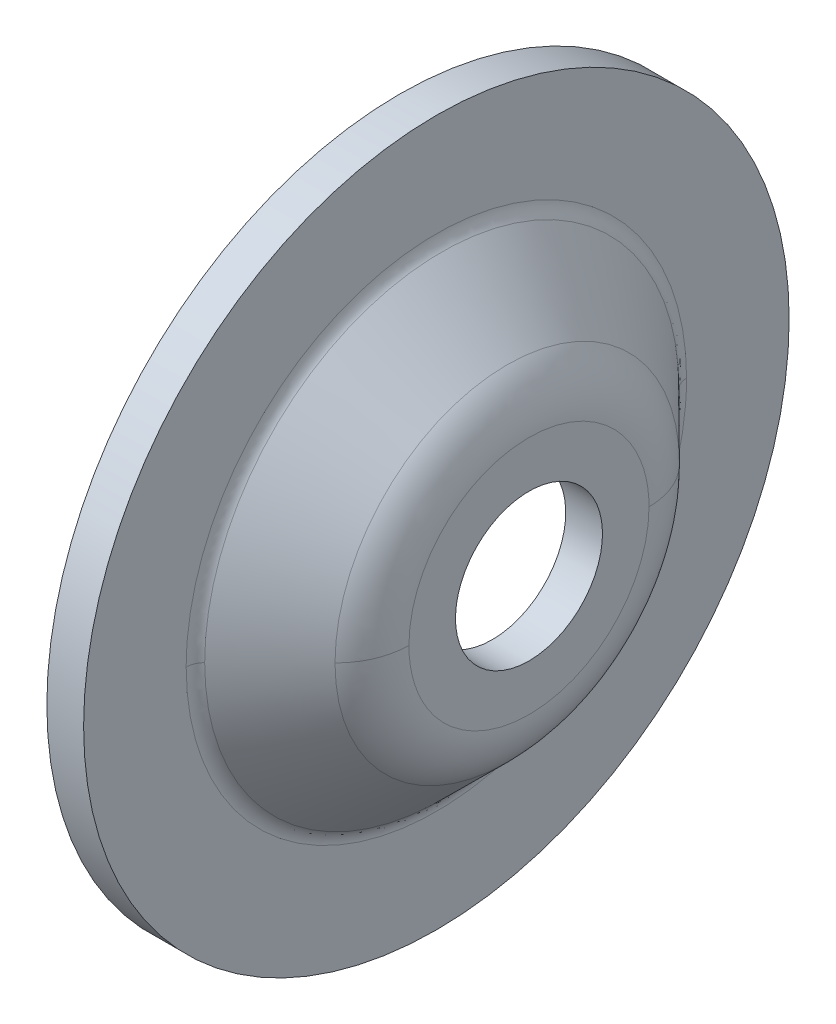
ISO-10303-21;
HEADER;
FILE_DESCRIPTION(('STEP AP214'),'2;1');
FILE_NAME('part.step','',(''),(''),'','','');
FILE_SCHEMA(('AUTOMOTIVE_DESIGN { 1 0 10303 214 1 1 1 1 }'));
ENDSEC;
DATA;
#1=APPLICATION_CONTEXT('core data for automotive mechanical design processes');
#2=APPLICATION_PROTOCOL_DEFINITION('international standard','automotive_design',2000,#1);
#3=PRODUCT_CONTEXT('',#1,'mechanical');
#4=PRODUCT('Part','Part','',(#3));
#5=PRODUCT_RELATED_PRODUCT_CATEGORY('part','',(#4));
#6=PRODUCT_DEFINITION_FORMATION('','',#4);
#7=PRODUCT_DEFINITION_CONTEXT('part definition',#1,'design');
#8=PRODUCT_DEFINITION('design','',#6,#7);
#9=PRODUCT_DEFINITION_SHAPE('','',#8);
#10=(LENGTH_UNIT() NAMED_UNIT(*) SI_UNIT(.MILLI.,.METRE.));
#11=(NAMED_UNIT(*) PLANE_ANGLE_UNIT() SI_UNIT($,.RADIAN.));
#12=(NAMED_UNIT(*) SI_UNIT($,.STERADIAN.) SOLID_ANGLE_UNIT());
#13=UNCERTAINTY_MEASURE_WITH_UNIT(LENGTH_MEASURE(1.E-05),#10,'distance_accuracy_value','');
#14=(GEOMETRIC_REPRESENTATION_CONTEXT(3) GLOBAL_UNCERTAINTY_ASSIGNED_CONTEXT((#13)) GLOBAL_UNIT_ASSIGNED_CONTEXT((#10,
#11,#12)) REPRESENTATION_CONTEXT('',''));
#15=CARTESIAN_POINT('',(0.,0.,0.));
#16=DIRECTION('',(0.,0.,1.));
#17=DIRECTION('',(1.,0.,0.));
#18=AXIS2_PLACEMENT_3D('',#15,#16,#17);
#19=CARTESIAN_POINT('',(7.295715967,0.,-12.906630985));
#20=CARTESIAN_POINT('',(7.295715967,-25.813261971,-12.906630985));
#21=CARTESIAN_POINT('',(7.295715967,-25.813261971,12.906630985));
#22=CARTESIAN_POINT('',(7.295715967,0.,12.906630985));
#23=CARTESIAN_POINT('',(7.103897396,0.,-13.096927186));
#24=CARTESIAN_POINT('',(7.103897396,-26.193854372,-13.096927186));
#25=CARTESIAN_POINT('',(7.103897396,-26.193854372,13.096927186));
#26=CARTESIAN_POINT('',(7.103897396,0.,13.096927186));
#27=CARTESIAN_POINT('',(7.,0.,-13.346351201));
#28=CARTESIAN_POINT('',(7.,-26.692702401,-13.346351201));
#29=CARTESIAN_POINT('',(7.,-26.692702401,13.346351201));
#30=CARTESIAN_POINT('',(7.,0.,13.346351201));
#31=CARTESIAN_POINT('',(7.,0.,-13.616549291));
#32=CARTESIAN_POINT('',(7.,-27.233098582,-13.616549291));
#33=CARTESIAN_POINT('',(7.,-27.233098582,13.616549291));
#34=CARTESIAN_POINT('',(7.,0.,13.616549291));
#35=(BOUNDED_SURFACE() B_SPLINE_SURFACE(3,3,((#19,#20,#21,#22),(#23,#24,#25,#26),(#27,#28,#29,
#30),(#31,#32,#33,#34)),.UNSPECIFIED.,.F.,.F.,.F.) B_SPLINE_SURFACE_WITH_KNOTS((4,4),(4,4),(0.,
1.),(0.,1.),.UNSPECIFIED.) GEOMETRIC_REPRESENTATION_ITEM() RATIONAL_B_SPLINE_SURFACE(((1.,
0.333333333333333,0.333333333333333,1.),(0.948743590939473,0.316247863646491,0.316247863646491,
0.948743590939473),(0.948743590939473,0.316247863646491,0.316247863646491,0.948743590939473),
(1.,0.333333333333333,0.333333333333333,1.))) REPRESENTATION_ITEM('') SURFACE());
#36=CARTESIAN_POINT('',(7.295715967,0.,-12.906630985));
#37=CARTESIAN_POINT('',(7.103897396,0.,-13.096927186));
#38=CARTESIAN_POINT('',(7.,0.,-13.346351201));
#39=CARTESIAN_POINT('',(7.,0.,-13.616549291));
#40=(BOUNDED_CURVE() B_SPLINE_CURVE(3,(#36,#37,#38,#39),.UNSPECIFIED.,.F.,
.F.) B_SPLINE_CURVE_WITH_KNOTS((4,4),(0.,1.),
.UNSPECIFIED.) CURVE() GEOMETRIC_REPRESENTATION_ITEM() RATIONAL_B_SPLINE_CURVE((1.,
0.948743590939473,0.948743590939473,1.)) REPRESENTATION_ITEM(''));
#41=CARTESIAN_POINT('',(7.,-2.80245479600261E-09,-13.6165492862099));
#42=VERTEX_POINT('',#41);
#43=CARTESIAN_POINT('',(7.29571596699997,-3.30899283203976E-09,-12.906630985));
#44=VERTEX_POINT('',#43);
#45=EDGE_CURVE('E110',#42,#44,#40,.F.);
#46=CARTESIAN_POINT('',(7.29571596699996,0.,0.));
#47=DIRECTION('',(-1.,0.,0.));
#48=DIRECTION('',(0.,0.,1.));
#49=AXIS2_PLACEMENT_3D('',#46,#47,#48);
#50=CIRCLE('',#49,12.906630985);
#51=CARTESIAN_POINT('',(7.29571596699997,-1.15893322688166E-09,12.906630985));
#52=VERTEX_POINT('',#51);
#53=EDGE_CURVE('E114',#52,#44,#50,.F.);
#54=CARTESIAN_POINT('',(7.295715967,0.,12.906630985));
#55=CARTESIAN_POINT('',(7.103897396,0.,13.096927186));
#56=CARTESIAN_POINT('',(7.,0.,13.346351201));
#57=CARTESIAN_POINT('',(7.,0.,13.616549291));
#58=(BOUNDED_CURVE() B_SPLINE_CURVE(3,(#54,#55,#56,#57),.UNSPECIFIED.,.F.,
.F.) B_SPLINE_CURVE_WITH_KNOTS((4,4),(0.,1.),
.UNSPECIFIED.) CURVE() GEOMETRIC_REPRESENTATION_ITEM() RATIONAL_B_SPLINE_CURVE((1.,
0.948743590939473,0.948743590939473,1.)) REPRESENTATION_ITEM(''));
#59=CARTESIAN_POINT('',(7.,-2.80245479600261E-09,13.616549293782));
#60=VERTEX_POINT('',#59);
#61=EDGE_CURVE('E101',#52,#60,#58,.T.);
#62=CARTESIAN_POINT('',(7.,0.,13.6165492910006));
#63=CARTESIAN_POINT('',(7.,-0.144078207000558,13.6165501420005));
#64=CARTESIAN_POINT('',(7.,-0.288156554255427,13.6142625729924));
#65=CARTESIAN_POINT('',(7.,-0.580736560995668,13.6049715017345));
#66=CARTESIAN_POINT('',(7.,-0.729233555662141,13.5978207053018));
#67=CARTESIAN_POINT('',(7.,-1.03061212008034,13.5783568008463));
#68=CARTESIAN_POINT('',(7.,-1.18348360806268,13.5658873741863));
#69=CARTESIAN_POINT('',(7.,-1.4935383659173,13.5353161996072));
#70=CARTESIAN_POINT('',(7.,-1.65070533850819,13.5170490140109));
#71=CARTESIAN_POINT('',(7.,-1.96923924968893,13.4743882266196));
#72=CARTESIAN_POINT('',(7.,-2.13058281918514,13.4498200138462));
#73=CARTESIAN_POINT('',(7.,-2.45731386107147,13.3940412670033));
#74=CARTESIAN_POINT('',(7.,-2.62266998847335,13.36264702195));
#75=CARTESIAN_POINT('',(7.,-2.95722032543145,13.2926809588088));
#76=CARTESIAN_POINT('',(7.,-3.12637427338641,13.2539165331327));
#77=CARTESIAN_POINT('',(7.,-3.46825897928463,13.1686590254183));
#78=CARTESIAN_POINT('',(7.,-3.64093959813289,13.1219648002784));
#79=CARTESIAN_POINT('',(7.,-3.98955514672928,13.0202852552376));
#80=CARTESIAN_POINT('',(7.,-4.16542910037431,12.9650907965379));
#81=CARTESIAN_POINT('',(7.,-4.52004187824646,12.8458426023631));
#82=CARTESIAN_POINT('',(7.,-4.6987079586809,12.7815724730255));
#83=CARTESIAN_POINT('',(7.,-5.05844313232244,12.6436058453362));
#84=CARTESIAN_POINT('',(7.,-5.23942684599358,12.5696866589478));
#85=CARTESIAN_POINT('',(7.,-5.60325798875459,12.4118640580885));
#86=CARTESIAN_POINT('',(7.,-5.78600663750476,12.3277328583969));
#87=CARTESIAN_POINT('',(7.,-6.15274660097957,12.1489471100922));
#88=CARTESIAN_POINT('',(7.,-6.33662511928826,12.0540611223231));
#89=CARTESIAN_POINT('',(7.,-6.70491871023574,11.8532562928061));
#90=CARTESIAN_POINT('',(7.,-6.889206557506,11.747104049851));
#91=CARTESIAN_POINT('',(7.,-7.25752565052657,11.523299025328));
#92=CARTESIAN_POINT('',(7.,-7.44141508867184,11.405412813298));
#93=CARTESIAN_POINT('',(7.,-7.80805685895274,11.1577274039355));
#94=CARTESIAN_POINT('',(7.,-7.99065296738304,11.0276969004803));
#95=CARTESIAN_POINT('',(7.,-8.35374195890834,10.7553801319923));
#96=CARTESIAN_POINT('',(7.,-8.53406474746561,10.6128670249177));
#97=CARTESIAN_POINT('',(7.,-8.89155948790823,10.3153271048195));
#98=CARTESIAN_POINT('',(7.,-9.06854845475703,10.1600803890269));
#99=CARTESIAN_POINT('',(7.,-9.41825328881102,9.83691562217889));
#100=CARTESIAN_POINT('',(7.,-9.59077474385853,9.66878715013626));
#101=CARTESIAN_POINT('',(7.,-9.93035743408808,9.31981693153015));
#102=CARTESIAN_POINT('',(7.,-10.0972148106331,9.13877677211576));
#103=CARTESIAN_POINT('',(7.,-10.4242303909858,8.76407136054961));
#104=CARTESIAN_POINT('',(7.,-10.5841778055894,8.57022210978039));
#105=CARTESIAN_POINT('',(7.,-10.8960985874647,8.1701305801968));
#106=CARTESIAN_POINT('',(7.,-11.0478572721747,7.96372090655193));
#107=CARTESIAN_POINT('',(7.,-11.3421100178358,7.53889320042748));
#108=CARTESIAN_POINT('',(7.,-11.4843890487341,7.32032617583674));
#109=CARTESIAN_POINT('',(7.,-11.7583946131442,6.87173796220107));
#110=CARTESIAN_POINT('',(7.,-11.8899096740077,6.64158767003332));
#111=CARTESIAN_POINT('',(7.,-12.1411406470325,6.17052744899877));
#112=CARTESIAN_POINT('',(7.,-12.2606530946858,5.92950868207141));
#113=CARTESIAN_POINT('',(7.,-12.4296124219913,5.56179832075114));
#114=CARTESIAN_POINT('',(7.,-12.4844617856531,5.43756121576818));
#115=CARTESIAN_POINT('',(7.,-12.590745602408,5.18673327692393));
#116=CARTESIAN_POINT('',(7.,-12.6421571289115,5.0601326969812));
#117=CARTESIAN_POINT('',(7.,-12.74142696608,4.80471993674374));
#118=CARTESIAN_POINT('',(7.,-12.7892634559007,4.67589928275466));
#119=CARTESIAN_POINT('',(7.,-12.8812555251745,4.41619146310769));
#120=CARTESIAN_POINT('',(7.,-12.9253905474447,4.28529701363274));
#121=CARTESIAN_POINT('',(7.,-13.0098588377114,4.02159760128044));
#122=CARTESIAN_POINT('',(7.,-13.0501729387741,3.88878649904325));
#123=CARTESIAN_POINT('',(7.,-13.1268874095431,3.62141790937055));
#124=CARTESIAN_POINT('',(7.,-13.1632701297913,3.48685535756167));
#125=CARTESIAN_POINT('',(7.,-13.232019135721,3.21615614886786));
#126=CARTESIAN_POINT('',(7.,-13.2643694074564,3.08001542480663));
#127=CARTESIAN_POINT('',(7.,-13.3249608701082,2.80633947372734));
#128=CARTESIAN_POINT('',(7.,-13.3531877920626,2.66880108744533));
#129=CARTESIAN_POINT('',(7.,-13.4054505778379,2.39251604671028));
#130=CARTESIAN_POINT('',(7.,-13.4294740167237,2.25376704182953));
#131=CARTESIAN_POINT('',(7.,-13.4732591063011,1.97525282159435));
#132=CARTESIAN_POINT('',(7.,-13.4930102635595,1.83548595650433));
#133=CARTESIAN_POINT('',(7.,-13.5281918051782,1.55513304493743));
#134=CARTESIAN_POINT('',(7.,-13.5436137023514,1.41454593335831));
#135=CARTESIAN_POINT('',(7.,-13.570089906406,1.13275362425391));
#136=CARTESIAN_POINT('',(7.,-13.5811377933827,0.991547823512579));
#137=CARTESIAN_POINT('',(7.,-13.5988316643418,0.708722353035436));
#138=CARTESIAN_POINT('',(7.,-13.6054733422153,0.56710241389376));
#139=CARTESIAN_POINT('',(7.,-13.6143332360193,0.283655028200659));
#140=CARTESIAN_POINT('',(7.,-13.6165492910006,0.14182751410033));
#141=CARTESIAN_POINT('',(7.,-13.6165492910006,-0.14182751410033));
#142=CARTESIAN_POINT('',(7.,-13.6143332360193,-0.283655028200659));
#143=CARTESIAN_POINT('',(7.,-13.6054733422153,-0.56710241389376));
#144=CARTESIAN_POINT('',(7.,-13.5988316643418,-0.708722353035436));
#145=CARTESIAN_POINT('',(7.,-13.5811377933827,-0.991547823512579));
#146=CARTESIAN_POINT('',(7.,-13.570089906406,-1.13275362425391));
#147=CARTESIAN_POINT('',(7.,-13.5436137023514,-1.41454593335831));
#148=CARTESIAN_POINT('',(7.,-13.5281918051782,-1.55513304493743));
#149=CARTESIAN_POINT('',(7.,-13.4930102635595,-1.83548595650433));
#150=CARTESIAN_POINT('',(7.,-13.4732591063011,-1.97525282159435));
#151=CARTESIAN_POINT('',(7.,-13.4294740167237,-2.25376704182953));
#152=CARTESIAN_POINT('',(7.,-13.4054505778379,-2.39251604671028));
#153=CARTESIAN_POINT('',(7.,-13.3531877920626,-2.66880108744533));
#154=CARTESIAN_POINT('',(7.,-13.3249608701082,-2.80633947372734));
#155=CARTESIAN_POINT('',(7.,-13.2643694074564,-3.08001542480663));
#156=CARTESIAN_POINT('',(7.,-13.232019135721,-3.21615614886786));
#157=CARTESIAN_POINT('',(7.,-13.1632701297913,-3.48685535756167));
#158=CARTESIAN_POINT('',(7.,-13.1268874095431,-3.62141790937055));
#159=CARTESIAN_POINT('',(7.,-13.0501729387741,-3.88878649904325));
#160=CARTESIAN_POINT('',(7.,-13.0098588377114,-4.02159760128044));
#161=CARTESIAN_POINT('',(7.,-12.9253905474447,-4.28529701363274));
#162=CARTESIAN_POINT('',(7.,-12.8812555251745,-4.41619146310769));
#163=CARTESIAN_POINT('',(7.,-12.7892634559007,-4.67589928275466));
#164=CARTESIAN_POINT('',(7.,-12.74142696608,-4.80471993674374));
#165=CARTESIAN_POINT('',(7.,-12.6421571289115,-5.0601326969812));
#166=CARTESIAN_POINT('',(7.,-12.590745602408,-5.18673327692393));
#167=CARTESIAN_POINT('',(7.,-12.4844617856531,-5.43756121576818));
#168=CARTESIAN_POINT('',(7.,-12.4296124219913,-5.56179832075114));
#169=CARTESIAN_POINT('',(7.,-12.2606530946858,-5.92950868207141));
#170=CARTESIAN_POINT('',(7.,-12.1411406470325,-6.17052744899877));
#171=CARTESIAN_POINT('',(7.,-11.8899096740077,-6.64158767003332));
#172=CARTESIAN_POINT('',(7.,-11.7583946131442,-6.87173796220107));
#173=CARTESIAN_POINT('',(7.,-11.4843890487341,-7.32032617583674));
#174=CARTESIAN_POINT('',(7.,-11.3421100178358,-7.53889320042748));
#175=CARTESIAN_POINT('',(7.,-11.0478572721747,-7.96372090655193));
#176=CARTESIAN_POINT('',(7.,-10.8960985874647,-8.1701305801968));
#177=CARTESIAN_POINT('',(7.,-10.5841778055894,-8.57022210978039));
#178=CARTESIAN_POINT('',(7.,-10.4242303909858,-8.76407136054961));
#179=CARTESIAN_POINT('',(7.,-10.0972148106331,-9.13877677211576));
#180=CARTESIAN_POINT('',(7.,-9.93035743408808,-9.31981693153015));
#181=CARTESIAN_POINT('',(7.,-9.59077474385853,-9.66878715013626));
#182=CARTESIAN_POINT('',(7.,-9.41825328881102,-9.83691562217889));
#183=CARTESIAN_POINT('',(7.,-9.06854845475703,-10.1600803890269));
#184=CARTESIAN_POINT('',(7.,-8.89155948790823,-10.3153271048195));
#185=CARTESIAN_POINT('',(7.,-8.53406474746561,-10.6128670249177));
#186=CARTESIAN_POINT('',(7.,-8.35374195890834,-10.7553801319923));
#187=CARTESIAN_POINT('',(7.,-7.99065296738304,-11.0276969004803));
#188=CARTESIAN_POINT('',(7.,-7.80805685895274,-11.1577274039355));
#189=CARTESIAN_POINT('',(7.,-7.44141508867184,-11.405412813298));
#190=CARTESIAN_POINT('',(7.,-7.25752565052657,-11.523299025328));
#191=CARTESIAN_POINT('',(7.,-6.889206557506,-11.747104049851));
#192=CARTESIAN_POINT('',(7.,-6.70491871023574,-11.8532562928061));
#193=CARTESIAN_POINT('',(7.,-6.33662511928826,-12.0540611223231));
#194=CARTESIAN_POINT('',(7.,-6.15274660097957,-12.1489471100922));
#195=CARTESIAN_POINT('',(7.,-5.78600663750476,-12.3277328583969));
#196=CARTESIAN_POINT('',(7.,-5.60325798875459,-12.4118640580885));
#197=CARTESIAN_POINT('',(7.,-5.23942684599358,-12.5696866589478));
#198=CARTESIAN_POINT('',(7.,-5.05844313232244,-12.6436058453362));
#199=CARTESIAN_POINT('',(7.,-4.6987079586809,-12.7815724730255));
#200=CARTESIAN_POINT('',(7.,-4.52004187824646,-12.8458426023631));
#201=CARTESIAN_POINT('',(7.,-4.16542910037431,-12.9650907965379));
#202=CARTESIAN_POINT('',(7.,-3.98955514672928,-13.0202852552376));
#203=CARTESIAN_POINT('',(7.,-3.64093959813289,-13.1219648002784));
#204=CARTESIAN_POINT('',(7.,-3.46825897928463,-13.1686590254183));
#205=CARTESIAN_POINT('',(7.,-3.12637427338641,-13.2539165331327));
#206=CARTESIAN_POINT('',(7.,-2.95722032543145,-13.2926809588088));
#207=CARTESIAN_POINT('',(7.,-2.62266998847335,-13.36264702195));
#208=CARTESIAN_POINT('',(7.,-2.45731386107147,-13.3940412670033));
#209=CARTESIAN_POINT('',(7.,-2.13058281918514,-13.4498200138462));
#210=CARTESIAN_POINT('',(7.,-1.96923924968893,-13.4743882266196));
#211=CARTESIAN_POINT('',(7.,-1.65070533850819,-13.5170490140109));
#212=CARTESIAN_POINT('',(7.,-1.4935383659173,-13.5353161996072));
#213=CARTESIAN_POINT('',(7.,-1.18348360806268,-13.5658873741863));
#214=CARTESIAN_POINT('',(7.,-1.03061212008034,-13.5783568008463));
#215=CARTESIAN_POINT('',(7.,-0.729233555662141,-13.5978207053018));
#216=CARTESIAN_POINT('',(7.,-0.580736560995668,-13.6049715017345));
#217=CARTESIAN_POINT('',(7.,-0.288156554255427,-13.6142625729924));
#218=CARTESIAN_POINT('',(7.,-0.144078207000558,-13.6165501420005));
#219=CARTESIAN_POINT('',(7.,0.,-13.6165492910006));
#220=B_SPLINE_CURVE_WITH_KNOTS('',3,(#62,#63,#64,#65,#66,#67,#68,#69,#70,#71,#72,#73,#74,#75,
#76,#77,#78,#79,#80,#81,#82,#83,#84,#85,#86,#87,#88,#89,#90,#91,#92,#93,#94,#95,#96,#97,#98,#99,
#100,#101,#102,#103,#104,#105,#106,#107,#108,#109,#110,#111,#112,#113,#114,#115,#116,#117,#118,
#119,#120,#121,#122,#123,#124,#125,#126,#127,#128,#129,#130,#131,#132,#133,#134,#135,#136,#137,
#138,#139,#140,#141,#142,#143,#144,#145,#146,#147,#148,#149,#150,#151,#152,#153,#154,#155,#156,
#157,#158,#159,#160,#161,#162,#163,#164,#165,#166,#167,#168,#169,#170,#171,#172,#173,#174,#175,
#176,#177,#178,#179,#180,#181,#182,#183,#184,#185,#186,#187,#188,#189,#190,#191,#192,#193,#194,
#195,#196,#197,#198,#199,#200,#201,#202,#203,#204,#205,#206,#207,#208,#209,#210,#211,#212,#213,
#214,#215,#216,#217,#218,#219),.UNSPECIFIED.,.F.,.F.,(4,2,2,2,2,2,2,2,2,2,2,2,2,2,2,2,2,2,2,2,2,
2,2,2,2,2,2,2,2,2,2,2,2,2,2,2,2,2,2,2,2,2,2,2,2,2,2,2,2,2,2,2,2,2,2,2,2,2,2,2,2,2,2,2,2,2,2,2,2,
2,2,2,2,2,2,2,2,2,4),(0.,0.43221696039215,0.878144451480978,1.33819450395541,1.81277338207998,
2.30227808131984,2.8070923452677,3.32758217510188,3.8640908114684,4.41693317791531,
4.98638978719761,5.57270012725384,6.17605556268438,6.79659181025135,7.43438107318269,
8.0894239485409,8.76164125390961,9.45086595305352,10.1568353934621,10.8791840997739,
11.6174373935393,12.3710061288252,13.1391828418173,13.9211396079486,14.7159278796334,
15.522480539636,15.9298492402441,16.3397083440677,16.7518934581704,17.1662340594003,
17.5825538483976,18.0006711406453,18.4203992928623,18.8415471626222,19.2639195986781,
19.6873179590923,20.1115406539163,20.5363837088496,20.9616413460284,21.387106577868,
21.8125718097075,22.2378294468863,22.6626725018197,23.0868951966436,23.5102935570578,
23.9326659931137,24.3538138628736,24.7735420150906,25.1916593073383,25.6079790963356,
26.0223196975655,26.4345048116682,26.8443639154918,27.2517326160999,28.0582852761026,
28.8530735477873,29.6350303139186,30.4032070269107,31.1567757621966,31.8950290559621,
32.6173777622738,33.3233472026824,34.0125719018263,34.684789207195,35.3398320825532,
35.9776213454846,36.5981575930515,37.2015130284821,37.7878233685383,38.3572799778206,
38.9101223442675,39.446630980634,39.9671208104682,40.4719350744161,40.9614397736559,
41.4360186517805,41.8960687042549,42.3419961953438,42.7742131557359),.UNSPECIFIED.);
#221=EDGE_CURVE('E94',#60,#42,#220,.T.);
#222=ORIENTED_EDGE('',*,*,#45,.T.);
#223=ORIENTED_EDGE('',*,*,#53,.F.);
#224=ORIENTED_EDGE('',*,*,#61,.T.);
#225=ORIENTED_EDGE('',*,*,#221,.T.);
#226=EDGE_LOOP('',(#222,#223,#224,#225));
#227=FACE_BOUND('',#226,.T.);
#228=ADVANCED_FACE('F32',(#227),#35,.F.);
#229=CARTESIAN_POINT('',(7.295715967,0.,12.906630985));
#230=CARTESIAN_POINT('',(7.295715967,25.813261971,12.906630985));
#231=CARTESIAN_POINT('',(7.295715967,25.813261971,-12.906630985));
#232=CARTESIAN_POINT('',(7.295715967,0.,-12.906630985));
#233=CARTESIAN_POINT('',(7.103897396,0.,13.096927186));
#234=CARTESIAN_POINT('',(7.103897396,26.193854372,13.096927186));
#235=CARTESIAN_POINT('',(7.103897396,26.193854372,-13.096927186));
#236=CARTESIAN_POINT('',(7.103897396,0.,-13.096927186));
#237=CARTESIAN_POINT('',(7.,0.,13.346351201));
#238=CARTESIAN_POINT('',(7.,26.692702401,13.346351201));
#239=CARTESIAN_POINT('',(7.,26.692702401,-13.346351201));
#240=CARTESIAN_POINT('',(7.,0.,-13.346351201));
#241=CARTESIAN_POINT('',(7.,0.,13.616549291));
#242=CARTESIAN_POINT('',(7.,27.233098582,13.616549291));
#243=CARTESIAN_POINT('',(7.,27.233098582,-13.616549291));
#244=CARTESIAN_POINT('',(7.,0.,-13.616549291));
#245=(BOUNDED_SURFACE() B_SPLINE_SURFACE(3,3,((#229,#230,#231,#232),(#233,#234,#235,#236),(#237,
#238,#239,#240),(#241,#242,#243,#244)),.UNSPECIFIED.,.F.,.F.,
.F.) B_SPLINE_SURFACE_WITH_KNOTS((4,4),(4,4),(0.,1.),(0.,1.),
.UNSPECIFIED.) GEOMETRIC_REPRESENTATION_ITEM() RATIONAL_B_SPLINE_SURFACE(((1.,0.333333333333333,
0.333333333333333,1.),(0.948743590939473,0.316247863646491,0.316247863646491,0.948743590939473),
(0.948743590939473,0.316247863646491,0.316247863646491,0.948743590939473),(1.,0.333333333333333,
0.333333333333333,1.))) REPRESENTATION_ITEM('') SURFACE());
#246=CARTESIAN_POINT('',(7.,0.,-13.6165492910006));
#247=CARTESIAN_POINT('',(7.,0.144078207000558,-13.6165501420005));
#248=CARTESIAN_POINT('',(7.,0.288156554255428,-13.6142625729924));
#249=CARTESIAN_POINT('',(7.,0.580736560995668,-13.6049715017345));
#250=CARTESIAN_POINT('',(7.,0.729233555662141,-13.5978207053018));
#251=CARTESIAN_POINT('',(7.,1.03061212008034,-13.5783568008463));
#252=CARTESIAN_POINT('',(7.,1.18348360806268,-13.5658873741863));
#253=CARTESIAN_POINT('',(7.,1.4935383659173,-13.5353161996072));
#254=CARTESIAN_POINT('',(7.,1.65070533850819,-13.5170490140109));
#255=CARTESIAN_POINT('',(7.,1.96923924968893,-13.4743882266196));
#256=CARTESIAN_POINT('',(7.,2.13058281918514,-13.4498200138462));
#257=CARTESIAN_POINT('',(7.,2.45731386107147,-13.3940412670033));
#258=CARTESIAN_POINT('',(7.,2.62266998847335,-13.36264702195));
#259=CARTESIAN_POINT('',(7.,2.95722032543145,-13.2926809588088));
#260=CARTESIAN_POINT('',(7.,3.12637427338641,-13.2539165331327));
#261=CARTESIAN_POINT('',(7.,3.46825897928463,-13.1686590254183));
#262=CARTESIAN_POINT('',(7.,3.64093959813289,-13.1219648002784));
#263=CARTESIAN_POINT('',(7.,3.98955514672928,-13.0202852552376));
#264=CARTESIAN_POINT('',(7.,4.16542910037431,-12.9650907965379));
#265=CARTESIAN_POINT('',(7.,4.52004187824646,-12.8458426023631));
#266=CARTESIAN_POINT('',(7.,4.6987079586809,-12.7815724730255));
#267=CARTESIAN_POINT('',(7.,5.05844313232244,-12.6436058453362));
#268=CARTESIAN_POINT('',(7.,5.23942684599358,-12.5696866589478));
#269=CARTESIAN_POINT('',(7.,5.60325798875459,-12.4118640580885));
#270=CARTESIAN_POINT('',(7.,5.78600663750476,-12.3277328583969));
#271=CARTESIAN_POINT('',(7.,6.15274660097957,-12.1489471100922));
#272=CARTESIAN_POINT('',(7.,6.33662511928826,-12.0540611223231));
#273=CARTESIAN_POINT('',(7.,6.70491871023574,-11.8532562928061));
#274=CARTESIAN_POINT('',(7.,6.889206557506,-11.747104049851));
#275=CARTESIAN_POINT('',(7.,7.25752565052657,-11.523299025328));
#276=CARTESIAN_POINT('',(7.,7.44141508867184,-11.405412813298));
#277=CARTESIAN_POINT('',(7.,7.80805685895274,-11.1577274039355));
#278=CARTESIAN_POINT('',(7.,7.99065296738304,-11.0276969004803));
#279=CARTESIAN_POINT('',(7.,8.35374195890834,-10.7553801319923));
#280=CARTESIAN_POINT('',(7.,8.53406474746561,-10.6128670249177));
#281=CARTESIAN_POINT('',(7.,8.89155948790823,-10.3153271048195));
#282=CARTESIAN_POINT('',(7.,9.06854845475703,-10.1600803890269));
#283=CARTESIAN_POINT('',(7.,9.41825328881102,-9.83691562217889));
#284=CARTESIAN_POINT('',(7.,9.59077474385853,-9.66878715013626));
#285=CARTESIAN_POINT('',(7.,9.93035743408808,-9.31981693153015));
#286=CARTESIAN_POINT('',(7.,10.0972148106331,-9.13877677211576));
#287=CARTESIAN_POINT('',(7.,10.4242303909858,-8.76407136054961));
#288=CARTESIAN_POINT('',(7.,10.5841778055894,-8.57022210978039));
#289=CARTESIAN_POINT('',(7.,10.8960985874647,-8.1701305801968));
#290=CARTESIAN_POINT('',(7.,11.0478572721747,-7.96372090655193));
#291=CARTESIAN_POINT('',(7.,11.3421100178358,-7.53889320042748));
#292=CARTESIAN_POINT('',(7.,11.4843890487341,-7.32032617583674));
#293=CARTESIAN_POINT('',(7.,11.7583946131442,-6.87173796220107));
#294=CARTESIAN_POINT('',(7.,11.8899096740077,-6.64158767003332));
#295=CARTESIAN_POINT('',(7.,12.1411406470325,-6.17052744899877));
#296=CARTESIAN_POINT('',(7.,12.2606530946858,-5.92950868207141));
#297=CARTESIAN_POINT('',(7.,12.4296124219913,-5.56179832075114));
#298=CARTESIAN_POINT('',(7.,12.4844617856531,-5.43756121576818));
#299=CARTESIAN_POINT('',(7.,12.590745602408,-5.18673327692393));
#300=CARTESIAN_POINT('',(7.,12.6421571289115,-5.0601326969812));
#301=CARTESIAN_POINT('',(7.,12.74142696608,-4.80471993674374));
#302=CARTESIAN_POINT('',(7.,12.7892634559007,-4.67589928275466));
#303=CARTESIAN_POINT('',(7.,12.8812555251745,-4.41619146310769));
#304=CARTESIAN_POINT('',(7.,12.9253905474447,-4.28529701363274));
#305=CARTESIAN_POINT('',(7.,13.0098588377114,-4.02159760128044));
#306=CARTESIAN_POINT('',(7.,13.0501729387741,-3.88878649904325));
#307=CARTESIAN_POINT('',(7.,13.1268874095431,-3.62141790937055));
#308=CARTESIAN_POINT('',(7.,13.1632701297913,-3.48685535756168));
#309=CARTESIAN_POINT('',(7.,13.232019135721,-3.21615614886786));
#310=CARTESIAN_POINT('',(7.,13.2643694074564,-3.08001542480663));
#311=CARTESIAN_POINT('',(7.,13.3249608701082,-2.80633947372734));
#312=CARTESIAN_POINT('',(7.,13.3531877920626,-2.66880108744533));
#313=CARTESIAN_POINT('',(7.,13.4054505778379,-2.39251604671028));
#314=CARTESIAN_POINT('',(7.,13.4294740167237,-2.25376704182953));
#315=CARTESIAN_POINT('',(7.,13.4732591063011,-1.97525282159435));
#316=CARTESIAN_POINT('',(7.,13.4930102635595,-1.83548595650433));
#317=CARTESIAN_POINT('',(7.,13.5281918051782,-1.55513304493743));
#318=CARTESIAN_POINT('',(7.,13.5436137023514,-1.41454593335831));
#319=CARTESIAN_POINT('',(7.,13.570089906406,-1.13275362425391));
#320=CARTESIAN_POINT('',(7.,13.5811377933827,-0.99154782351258));
#321=CARTESIAN_POINT('',(7.,13.5988316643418,-0.708722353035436));
#322=CARTESIAN_POINT('',(7.,13.6054733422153,-0.56710241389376));
#323=CARTESIAN_POINT('',(7.,13.6143332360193,-0.283655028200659));
#324=CARTESIAN_POINT('',(7.,13.6165492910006,-0.14182751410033));
#325=CARTESIAN_POINT('',(7.,13.6165492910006,0.14182751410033));
#326=CARTESIAN_POINT('',(7.,13.6143332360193,0.283655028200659));
#327=CARTESIAN_POINT('',(7.,13.6054733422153,0.56710241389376));
#328=CARTESIAN_POINT('',(7.,13.5988316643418,0.708722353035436));
#329=CARTESIAN_POINT('',(7.,13.5811377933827,0.99154782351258));
#330=CARTESIAN_POINT('',(7.,13.570089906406,1.13275362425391));
#331=CARTESIAN_POINT('',(7.,13.5436137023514,1.41454593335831));
#332=CARTESIAN_POINT('',(7.,13.5281918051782,1.55513304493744));
#333=CARTESIAN_POINT('',(7.,13.4930102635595,1.83548595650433));
#334=CARTESIAN_POINT('',(7.,13.4732591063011,1.97525282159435));
#335=CARTESIAN_POINT('',(7.,13.4294740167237,2.25376704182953));
#336=CARTESIAN_POINT('',(7.,13.4054505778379,2.39251604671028));
#337=CARTESIAN_POINT('',(7.,13.3531877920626,2.66880108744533));
#338=CARTESIAN_POINT('',(7.,13.3249608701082,2.80633947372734));
#339=CARTESIAN_POINT('',(7.,13.2643694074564,3.08001542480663));
#340=CARTESIAN_POINT('',(7.,13.232019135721,3.21615614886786));
#341=CARTESIAN_POINT('',(7.,13.1632701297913,3.48685535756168));
#342=CARTESIAN_POINT('',(7.,13.1268874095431,3.62141790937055));
#343=CARTESIAN_POINT('',(7.,13.0501729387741,3.88878649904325));
#344=CARTESIAN_POINT('',(7.,13.0098588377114,4.02159760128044));
#345=CARTESIAN_POINT('',(7.,12.9253905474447,4.28529701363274));
#346=CARTESIAN_POINT('',(7.,12.8812555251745,4.41619146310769));
#347=CARTESIAN_POINT('',(7.,12.7892634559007,4.67589928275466));
#348=CARTESIAN_POINT('',(7.,12.74142696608,4.80471993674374));
#349=CARTESIAN_POINT('',(7.,12.6421571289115,5.0601326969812));
#350=CARTESIAN_POINT('',(7.,12.590745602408,5.18673327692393));
#351=CARTESIAN_POINT('',(7.,12.4844617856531,5.43756121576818));
#352=CARTESIAN_POINT('',(7.,12.4296124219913,5.56179832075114));
#353=CARTESIAN_POINT('',(7.,12.2606530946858,5.92950868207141));
#354=CARTESIAN_POINT('',(7.,12.1411406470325,6.17052744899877));
#355=CARTESIAN_POINT('',(7.,11.8899096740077,6.64158767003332));
#356=CARTESIAN_POINT('',(7.,11.7583946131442,6.87173796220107));
#357=CARTESIAN_POINT('',(7.,11.4843890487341,7.32032617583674));
#358=CARTESIAN_POINT('',(7.,11.3421100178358,7.53889320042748));
#359=CARTESIAN_POINT('',(7.,11.0478572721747,7.96372090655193));
#360=CARTESIAN_POINT('',(7.,10.8960985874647,8.1701305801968));
#361=CARTESIAN_POINT('',(7.,10.5841778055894,8.57022210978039));
#362=CARTESIAN_POINT('',(7.,10.4242303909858,8.76407136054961));
#363=CARTESIAN_POINT('',(7.,10.0972148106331,9.13877677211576));
#364=CARTESIAN_POINT('',(7.,9.93035743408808,9.31981693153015));
#365=CARTESIAN_POINT('',(7.,9.59077474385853,9.66878715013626));
#366=CARTESIAN_POINT('',(7.,9.41825328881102,9.83691562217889));
#367=CARTESIAN_POINT('',(7.,9.06854845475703,10.1600803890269));
#368=CARTESIAN_POINT('',(7.,8.89155948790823,10.3153271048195));
#369=CARTESIAN_POINT('',(7.,8.53406474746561,10.6128670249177));
#370=CARTESIAN_POINT('',(7.,8.35374195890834,10.7553801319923));
#371=CARTESIAN_POINT('',(7.,7.99065296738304,11.0276969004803));
#372=CARTESIAN_POINT('',(7.,7.80805685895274,11.1577274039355));
#373=CARTESIAN_POINT('',(7.,7.44141508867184,11.405412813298));
#374=CARTESIAN_POINT('',(7.,7.25752565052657,11.523299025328));
#375=CARTESIAN_POINT('',(7.,6.889206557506,11.747104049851));
#376=CARTESIAN_POINT('',(7.,6.70491871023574,11.8532562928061));
#377=CARTESIAN_POINT('',(7.,6.33662511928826,12.0540611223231));
#378=CARTESIAN_POINT('',(7.,6.15274660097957,12.1489471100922));
#379=CARTESIAN_POINT('',(7.,5.78600663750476,12.3277328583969));
#380=CARTESIAN_POINT('',(7.,5.60325798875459,12.4118640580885));
#381=CARTESIAN_POINT('',(7.,5.23942684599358,12.5696866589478));
#382=CARTESIAN_POINT('',(7.,5.05844313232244,12.6436058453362));
#383=CARTESIAN_POINT('',(7.,4.6987079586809,12.7815724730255));
#384=CARTESIAN_POINT('',(7.,4.52004187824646,12.8458426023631));
#385=CARTESIAN_POINT('',(7.,4.16542910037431,12.9650907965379));
#386=CARTESIAN_POINT('',(7.,3.98955514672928,13.0202852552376));
#387=CARTESIAN_POINT('',(7.,3.64093959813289,13.1219648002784));
#388=CARTESIAN_POINT('',(7.,3.46825897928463,13.1686590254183));
#389=CARTESIAN_POINT('',(7.,3.12637427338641,13.2539165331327));
#390=CARTESIAN_POINT('',(7.,2.95722032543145,13.2926809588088));
#391=CARTESIAN_POINT('',(7.,2.62266998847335,13.36264702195));
#392=CARTESIAN_POINT('',(7.,2.45731386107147,13.3940412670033));
#393=CARTESIAN_POINT('',(7.,2.13058281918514,13.4498200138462));
#394=CARTESIAN_POINT('',(7.,1.96923924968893,13.4743882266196));
#395=CARTESIAN_POINT('',(7.,1.65070533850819,13.5170490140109));
#396=CARTESIAN_POINT('',(7.,1.4935383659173,13.5353161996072));
#397=CARTESIAN_POINT('',(7.,1.18348360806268,13.5658873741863));
#398=CARTESIAN_POINT('',(7.,1.03061212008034,13.5783568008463));
#399=CARTESIAN_POINT('',(7.,0.729233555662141,13.5978207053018));
#400=CARTESIAN_POINT('',(7.,0.580736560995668,13.6049715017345));
#401=CARTESIAN_POINT('',(7.,0.288156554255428,13.6142625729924));
#402=CARTESIAN_POINT('',(7.,0.144078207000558,13.6165501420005));
#403=CARTESIAN_POINT('',(7.,0.,13.6165492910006));
#404=B_SPLINE_CURVE_WITH_KNOTS('',3,(#246,#247,#248,#249,#250,#251,#252,#253,#254,#255,#256,
#257,#258,#259,#260,#261,#262,#263,#264,#265,#266,#267,#268,#269,#270,#271,#272,#273,#274,#275,
#276,#277,#278,#279,#280,#281,#282,#283,#284,#285,#286,#287,#288,#289,#290,#291,#292,#293,#294,
#295,#296,#297,#298,#299,#300,#301,#302,#303,#304,#305,#306,#307,#308,#309,#310,#311,#312,#313,
#314,#315,#316,#317,#318,#319,#320,#321,#322,#323,#324,#325,#326,#327,#328,#329,#330,#331,#332,
#333,#334,#335,#336,#337,#338,#339,#340,#341,#342,#343,#344,#345,#346,#347,#348,#349,#350,#351,
#352,#353,#354,#355,#356,#357,#358,#359,#360,#361,#362,#363,#364,#365,#366,#367,#368,#369,#370,
#371,#372,#373,#374,#375,#376,#377,#378,#379,#380,#381,#382,#383,#384,#385,#386,#387,#388,#389,
#390,#391,#392,#393,#394,#395,#396,#397,#398,#399,#400,#401,#402,#403),.UNSPECIFIED.,.F.,.F.,(4,
2,2,2,2,2,2,2,2,2,2,2,2,2,2,2,2,2,2,2,2,2,2,2,2,2,2,2,2,2,2,2,2,2,2,2,2,2,2,2,2,2,2,2,2,2,2,2,2,
2,2,2,2,2,2,2,2,2,2,2,2,2,2,2,2,2,2,2,2,2,2,2,2,2,2,2,2,2,4),(0.,0.43221696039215,
0.878144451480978,1.33819450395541,1.81277338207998,2.30227808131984,2.8070923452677,
3.32758217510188,3.8640908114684,4.41693317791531,4.98638978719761,5.57270012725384,
6.17605556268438,6.79659181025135,7.43438107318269,8.0894239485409,8.76164125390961,
9.45086595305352,10.1568353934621,10.8791840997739,11.6174373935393,12.3710061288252,
13.1391828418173,13.9211396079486,14.7159278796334,15.522480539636,15.9298492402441,
16.3397083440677,16.7518934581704,17.1662340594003,17.5825538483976,18.0006711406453,
18.4203992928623,18.8415471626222,19.2639195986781,19.6873179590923,20.1115406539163,
20.5363837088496,20.9616413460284,21.387106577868,21.8125718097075,22.2378294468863,
22.6626725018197,23.0868951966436,23.5102935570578,23.9326659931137,24.3538138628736,
24.7735420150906,25.1916593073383,25.6079790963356,26.0223196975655,26.4345048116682,
26.8443639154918,27.2517326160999,28.0582852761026,28.8530735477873,29.6350303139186,
30.4032070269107,31.1567757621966,31.8950290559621,32.6173777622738,33.3233472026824,
34.0125719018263,34.684789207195,35.3398320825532,35.9776213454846,36.5981575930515,
37.2015130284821,37.7878233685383,38.3572799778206,38.9101223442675,39.446630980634,
39.9671208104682,40.4719350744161,40.9614397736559,41.4360186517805,41.8960687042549,
42.3419961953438,42.7742131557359),.UNSPECIFIED.);
#405=EDGE_CURVE('E106',#42,#60,#404,.T.);
#406=CARTESIAN_POINT('',(7.29571596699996,0.,0.));
#407=DIRECTION('',(-1.,0.,0.));
#408=DIRECTION('',(0.,0.,1.));
#409=AXIS2_PLACEMENT_3D('',#406,#407,#408);
#410=CIRCLE('',#409,12.906630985);
#411=EDGE_CURVE('E104',#44,#52,#410,.F.);
#412=ORIENTED_EDGE('',*,*,#405,.T.);
#413=ORIENTED_EDGE('',*,*,#61,.F.);
#414=ORIENTED_EDGE('',*,*,#411,.F.);
#415=ORIENTED_EDGE('',*,*,#45,.F.);
#416=EDGE_LOOP('',(#412,#413,#414,#415));
#417=FACE_BOUND('',#416,.T.);
#418=ADVANCED_FACE('F103',(#417),#245,.F.);
#419=CARTESIAN_POINT('',(10.857136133,0.,0.));
#420=DIRECTION('',(-1.,0.,0.));
#421=DIRECTION('',(0.,0.,1.));
#422=AXIS2_PLACEMENT_3D('',#419,#420,#421);
#423=CONICAL_SURFACE('',#422,9.373476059,0.781414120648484);
#424=CARTESIAN_POINT('',(10.857136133,0.,0.));
#425=DIRECTION('',(1.,0.,0.));
#426=DIRECTION('',(0.,0.,-1.));
#427=AXIS2_PLACEMENT_3D('',#424,#425,#426);
#428=CIRCLE('',#427,9.373476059);
#429=CARTESIAN_POINT('',(10.857136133,-1.44189905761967E-09,-9.373476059));
#430=VERTEX_POINT('',#429);
#431=CARTESIAN_POINT('',(10.857136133,-4.2083921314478E-10,9.373476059));
#432=VERTEX_POINT('',#431);
#433=EDGE_CURVE('E308',#430,#432,#428,.T.);
#434=ORIENTED_EDGE('',*,*,#433,.F.);
#435=CARTESIAN_POINT('',(10.857136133,0.,0.));
#436=DIRECTION('',(1.,0.,0.));
#437=DIRECTION('',(0.,0.,-1.));
#438=AXIS2_PLACEMENT_3D('',#435,#436,#437);
#439=CIRCLE('',#438,9.373476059);
#440=EDGE_CURVE('E248',#432,#430,#439,.T.);
#441=ORIENTED_EDGE('',*,*,#440,.F.);
#442=EDGE_LOOP('',(#434,#441));
#443=FACE_BOUND('',#442,.T.);
#444=ORIENTED_EDGE('',*,*,#53,.T.);
#445=ORIENTED_EDGE('',*,*,#411,.T.);
#446=EDGE_LOOP('',(#444,#445));
#447=FACE_BOUND('',#446,.T.);
#448=ADVANCED_FACE('F113',(#443,#447),#423,.T.);
#449=CARTESIAN_POINT('',(7.,-19.58055716,-19.54679746));
#450=DIRECTION('',(-1.,0.,0.));
#451=DIRECTION('',(0.,0.,1.));
#452=AXIS2_PLACEMENT_3D('',#449,#450,#451);
#453=PLANE('',#452);
#454=ORIENTED_EDGE('',*,*,#221,.F.);
#455=ORIENTED_EDGE('',*,*,#405,.F.);
#456=EDGE_LOOP('',(#454,#455));
#457=FACE_BOUND('',#456,.T.);
#458=CARTESIAN_POINT('',(7.,0.,0.));
#459=DIRECTION('',(-1.,0.,0.));
#460=DIRECTION('',(0.,-1.,0.));
#461=AXIS2_PLACEMENT_3D('',#458,#459,#460);
#462=CIRCLE('',#461,19.2);
#463=CARTESIAN_POINT('',(7.,-19.2,0.));
#464=VERTEX_POINT('',#463);
#465=EDGE_CURVE('E37',#464,#464,#462,.T.);
#466=ORIENTED_EDGE('',*,*,#465,.F.);
#467=EDGE_LOOP('',(#466));
#468=FACE_BOUND('',#467,.T.);
#469=ADVANCED_FACE('F127',(#457,#468),#453,.F.);
#470=CARTESIAN_POINT('',(10.857136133,0.,9.373476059));
#471=CARTESIAN_POINT('',(10.857136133,18.746952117,9.373476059));
#472=CARTESIAN_POINT('',(10.857136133,18.746952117,-9.373476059));
#473=CARTESIAN_POINT('',(10.857136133,0.,-9.373476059));
#474=CARTESIAN_POINT('',(11.624410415,0.,8.612291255));
#475=CARTESIAN_POINT('',(11.624410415,17.224582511,8.612291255));
#476=CARTESIAN_POINT('',(11.624410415,17.224582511,-8.612291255));
#477=CARTESIAN_POINT('',(11.624410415,0.,-8.612291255));
#478=CARTESIAN_POINT('',(12.04,0.,7.614595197));
#479=CARTESIAN_POINT('',(12.04,15.229190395,7.614595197));
#480=CARTESIAN_POINT('',(12.04,15.229190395,-7.614595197));
#481=CARTESIAN_POINT('',(12.04,0.,-7.614595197));
#482=CARTESIAN_POINT('',(12.04,0.,6.533802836));
#483=CARTESIAN_POINT('',(12.04,13.067605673,6.533802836));
#484=CARTESIAN_POINT('',(12.04,13.067605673,-6.533802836));
#485=CARTESIAN_POINT('',(12.04,0.,-6.533802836));
#486=(BOUNDED_SURFACE() B_SPLINE_SURFACE(3,3,((#470,#471,#472,#473),(#474,#475,#476,#477),(#478,
#479,#480,#481),(#482,#483,#484,#485)),.UNSPECIFIED.,.F.,.F.,
.F.) B_SPLINE_SURFACE_WITH_KNOTS((4,4),(4,4),(0.,1.),(0.,1.),
.UNSPECIFIED.) GEOMETRIC_REPRESENTATION_ITEM() RATIONAL_B_SPLINE_SURFACE(((1.,0.333333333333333,
0.333333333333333,1.),(0.948743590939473,0.316247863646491,0.316247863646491,0.948743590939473),
(0.948743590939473,0.316247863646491,0.316247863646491,0.948743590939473),(1.,0.333333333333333,
0.333333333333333,1.))) REPRESENTATION_ITEM('') SURFACE());
#487=CARTESIAN_POINT('',(10.857136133,0.,9.373476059));
#488=CARTESIAN_POINT('',(11.624410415,0.,8.612291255));
#489=CARTESIAN_POINT('',(12.04,0.,7.614595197));
#490=CARTESIAN_POINT('',(12.04,0.,6.533802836));
#491=(BOUNDED_CURVE() B_SPLINE_CURVE(3,(#487,#488,#489,#490),.UNSPECIFIED.,.F.,
.F.) B_SPLINE_CURVE_WITH_KNOTS((4,4),(0.,1.),
.UNSPECIFIED.) CURVE() GEOMETRIC_REPRESENTATION_ITEM() RATIONAL_B_SPLINE_CURVE((1.,
0.948743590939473,0.948743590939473,1.)) REPRESENTATION_ITEM(''));
#492=CARTESIAN_POINT('',(12.04,8.94217165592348E-10,6.53380283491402));
#493=VERTEX_POINT('',#492);
#494=EDGE_CURVE('E252',#493,#432,#491,.F.);
#495=CARTESIAN_POINT('',(12.04,0.,6.533802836));
#496=CARTESIAN_POINT('',(12.04,13.067605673,6.533802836));
#497=CARTESIAN_POINT('',(12.04,13.067605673,-6.533802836));
#498=CARTESIAN_POINT('',(12.04,0.,-6.533802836));
#499=(BOUNDED_CURVE() B_SPLINE_CURVE(3,(#495,#496,#497,#498),.UNSPECIFIED.,.F.,
.F.) B_SPLINE_CURVE_WITH_KNOTS((4,4),(0.,1.),
.UNSPECIFIED.) CURVE() GEOMETRIC_REPRESENTATION_ITEM() RATIONAL_B_SPLINE_CURVE((1.,
0.333333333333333,0.333333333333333,1.)) REPRESENTATION_ITEM(''));
#500=CARTESIAN_POINT('',(12.04,8.9421699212E-10,-6.5338028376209));
#501=VERTEX_POINT('',#500);
#502=EDGE_CURVE('E158',#493,#501,#499,.T.);
#503=CARTESIAN_POINT('',(10.857136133,0.,-9.373476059));
#504=CARTESIAN_POINT('',(11.624410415,0.,-8.612291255));
#505=CARTESIAN_POINT('',(12.04,0.,-7.614595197));
#506=CARTESIAN_POINT('',(12.04,0.,-6.533802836));
#507=(BOUNDED_CURVE() B_SPLINE_CURVE(3,(#503,#504,#505,#506),.UNSPECIFIED.,.F.,
.F.) B_SPLINE_CURVE_WITH_KNOTS((4,4),(0.,1.),
.UNSPECIFIED.) CURVE() GEOMETRIC_REPRESENTATION_ITEM() RATIONAL_B_SPLINE_CURVE((1.,
0.948743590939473,0.948743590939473,1.)) REPRESENTATION_ITEM(''));
#508=EDGE_CURVE('E255',#430,#501,#507,.T.);
#509=ORIENTED_EDGE('',*,*,#433,.T.);
#510=ORIENTED_EDGE('',*,*,#494,.F.);
#511=ORIENTED_EDGE('',*,*,#502,.T.);
#512=ORIENTED_EDGE('',*,*,#508,.F.);
#513=EDGE_LOOP('',(#509,#510,#511,#512));
#514=FACE_BOUND('',#513,.T.);
#515=ADVANCED_FACE('F137',(#514),#486,.T.);
#516=CARTESIAN_POINT('',(10.857136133,0.,-9.373476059));
#517=CARTESIAN_POINT('',(10.857136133,-18.746952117,-9.373476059));
#518=CARTESIAN_POINT('',(10.857136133,-18.746952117,9.373476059));
#519=CARTESIAN_POINT('',(10.857136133,0.,9.373476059));
#520=CARTESIAN_POINT('',(11.624410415,0.,-8.612291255));
#521=CARTESIAN_POINT('',(11.624410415,-17.224582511,-8.612291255));
#522=CARTESIAN_POINT('',(11.624410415,-17.224582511,8.612291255));
#523=CARTESIAN_POINT('',(11.624410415,0.,8.612291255));
#524=CARTESIAN_POINT('',(12.04,0.,-7.614595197));
#525=CARTESIAN_POINT('',(12.04,-15.229190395,-7.614595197));
#526=CARTESIAN_POINT('',(12.04,-15.229190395,7.614595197));
#527=CARTESIAN_POINT('',(12.04,0.,7.614595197));
#528=CARTESIAN_POINT('',(12.04,0.,-6.533802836));
#529=CARTESIAN_POINT('',(12.04,-13.067605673,-6.533802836));
#530=CARTESIAN_POINT('',(12.04,-13.067605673,6.533802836));
#531=CARTESIAN_POINT('',(12.04,0.,6.533802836));
#532=(BOUNDED_SURFACE() B_SPLINE_SURFACE(3,3,((#516,#517,#518,#519),(#520,#521,#522,#523),(#524,
#525,#526,#527),(#528,#529,#530,#531)),.UNSPECIFIED.,.F.,.F.,
.F.) B_SPLINE_SURFACE_WITH_KNOTS((4,4),(4,4),(0.,1.),(0.,1.),
.UNSPECIFIED.) GEOMETRIC_REPRESENTATION_ITEM() RATIONAL_B_SPLINE_SURFACE(((1.,0.333333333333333,
0.333333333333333,1.),(0.948743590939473,0.316247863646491,0.316247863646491,0.948743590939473),
(0.948743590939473,0.316247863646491,0.316247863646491,0.948743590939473),(1.,0.333333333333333,
0.333333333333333,1.))) REPRESENTATION_ITEM('') SURFACE());
#533=CARTESIAN_POINT('',(12.04,0.,-6.533802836));
#534=CARTESIAN_POINT('',(12.04,-13.067605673,-6.533802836));
#535=CARTESIAN_POINT('',(12.04,-13.067605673,6.533802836));
#536=CARTESIAN_POINT('',(12.04,0.,6.533802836));
#537=(BOUNDED_CURVE() B_SPLINE_CURVE(3,(#533,#534,#535,#536),.UNSPECIFIED.,.F.,
.F.) B_SPLINE_CURVE_WITH_KNOTS((4,4),(0.,1.),
.UNSPECIFIED.) CURVE() GEOMETRIC_REPRESENTATION_ITEM() RATIONAL_B_SPLINE_CURVE((1.,
0.333333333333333,0.333333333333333,1.)) REPRESENTATION_ITEM(''));
#538=EDGE_CURVE('E170',#501,#493,#537,.T.);
#539=ORIENTED_EDGE('',*,*,#494,.T.);
#540=ORIENTED_EDGE('',*,*,#440,.T.);
#541=ORIENTED_EDGE('',*,*,#508,.T.);
#542=ORIENTED_EDGE('',*,*,#538,.T.);
#543=EDGE_LOOP('',(#539,#540,#541,#542));
#544=FACE_BOUND('',#543,.T.);
#545=ADVANCED_FACE('F294',(#544),#532,.T.);
#546=CARTESIAN_POINT('',(7.,0.,0.));
#547=DIRECTION('',(-1.,0.,0.));
#548=DIRECTION('',(0.,-1.,0.));
#549=AXIS2_PLACEMENT_3D('',#546,#547,#548);
#550=CYLINDRICAL_SURFACE('',#549,19.2);
#551=CARTESIAN_POINT('',(5.,0.,0.));
#552=DIRECTION('',(-1.,0.,0.));
#553=DIRECTION('',(0.,-1.,0.));
#554=AXIS2_PLACEMENT_3D('',#551,#552,#553);
#555=CIRCLE('',#554,19.2);
#556=CARTESIAN_POINT('',(5.,-19.2,0.));
#557=VERTEX_POINT('',#556);
#558=EDGE_CURVE('E237',#557,#557,#555,.F.);
#559=ORIENTED_EDGE('',*,*,#558,.T.);
#560=EDGE_LOOP('',(#559));
#561=FACE_BOUND('',#560,.T.);
#562=ORIENTED_EDGE('',*,*,#465,.T.);
#563=EDGE_LOOP('',(#562));
#564=FACE_BOUND('',#563,.T.);
#565=ADVANCED_FACE('F354',(#561,#564),#550,.T.);
#566=CARTESIAN_POINT('',(12.04,-6.635129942,-6.651818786));
#567=DIRECTION('',(-1.,0.,0.));
#568=DIRECTION('',(0.,0.,1.));
#569=AXIS2_PLACEMENT_3D('',#566,#567,#568);
#570=PLANE('',#569);
#571=CARTESIAN_POINT('',(12.04,0.,0.));
#572=DIRECTION('',(-1.,0.,0.));
#573=DIRECTION('',(0.,-1.,0.));
#574=AXIS2_PLACEMENT_3D('',#571,#572,#573);
#575=CIRCLE('',#574,4.);
#576=CARTESIAN_POINT('',(12.04,-4.,0.));
#577=VERTEX_POINT('',#576);
#578=EDGE_CURVE('E233',#577,#577,#575,.T.);
#579=ORIENTED_EDGE('',*,*,#578,.T.);
#580=EDGE_LOOP('',(#579));
#581=FACE_BOUND('',#580,.T.);
#582=ORIENTED_EDGE('',*,*,#502,.F.);
#583=ORIENTED_EDGE('',*,*,#538,.F.);
#584=EDGE_LOOP('',(#582,#583));
#585=FACE_BOUND('',#584,.T.);
#586=ADVANCED_FACE('F143',(#581,#585),#570,.F.);
#587=CARTESIAN_POINT('',(5.,-19.58055716,19.431094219));
#588=DIRECTION('',(1.,0.,0.));
#589=DIRECTION('',(0.,0.,-1.));
#590=AXIS2_PLACEMENT_3D('',#587,#588,#589);
#591=PLANE('',#590);
#592=CARTESIAN_POINT('',(5.,0.,-14.0330985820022));
#593=CARTESIAN_POINT('',(5.,-0.148485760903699,-14.0330994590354));
#594=CARTESIAN_POINT('',(5.,-0.296971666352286,-14.0307419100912));
#595=CARTESIAN_POINT('',(5.,-0.598502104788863,-14.0211666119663));
#596=CARTESIAN_POINT('',(5.,-0.75154183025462,-14.0137970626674));
#597=CARTESIAN_POINT('',(5.,-1.06213998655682,-13.9937377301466));
#598=CARTESIAN_POINT('',(5.,-1.21968802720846,-13.9808868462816));
#599=CARTESIAN_POINT('',(5.,-1.53922779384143,-13.9493804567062));
#600=CARTESIAN_POINT('',(5.,-1.70120272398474,-13.9305544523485));
#601=CARTESIAN_POINT('',(5.,-2.02948103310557,-13.8865886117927));
#602=CARTESIAN_POINT('',(5.,-2.19576032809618,-13.8612688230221));
#603=CARTESIAN_POINT('',(5.,-2.53248652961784,-13.8037837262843));
#604=CARTESIAN_POINT('',(5.,-2.70290113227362,-13.7714290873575));
#605=CARTESIAN_POINT('',(5.,-3.04768583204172,-13.6993226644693));
#606=CARTESIAN_POINT('',(5.,-3.22201443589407,-13.6593723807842));
#607=CARTESIAN_POINT('',(5.,-3.57435787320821,-13.5715067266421));
#608=CARTESIAN_POINT('',(5.,-3.75232103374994,-13.5233840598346));
#609=CARTESIAN_POINT('',(5.,-4.11160121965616,-13.4185939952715));
#610=CARTESIAN_POINT('',(5.,-4.29285540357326,-13.3617110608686));
#611=CARTESIAN_POINT('',(5.,-4.65831628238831,-13.2388148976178));
#612=CARTESIAN_POINT('',(5.,-4.84244800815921,-13.1725786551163));
#613=CARTESIAN_POINT('',(5.,-5.21318798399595,-13.0303914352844));
#614=CARTESIAN_POINT('',(5.,-5.3997082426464,-12.9542109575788));
#615=CARTESIAN_POINT('',(5.,-5.77466948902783,-12.7915603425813));
#616=CARTESIAN_POINT('',(5.,-5.96300867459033,-12.7048554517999));
#617=CARTESIAN_POINT('',(5.,-6.34096772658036,-12.5206003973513));
#618=CARTESIAN_POINT('',(5.,-6.53047134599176,-12.4228117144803));
#619=CARTESIAN_POINT('',(5.,-6.91003155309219,-12.2158639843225));
#620=CARTESIAN_POINT('',(5.,-7.09995702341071,-12.106464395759));
#621=CARTESIAN_POINT('',(5.,-7.47954351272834,-11.875812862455));
#622=CARTESIAN_POINT('',(5.,-7.66905838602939,-11.754320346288));
#623=CARTESIAN_POINT('',(5.,-8.04691624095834,-11.4990578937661));
#624=CARTESIAN_POINT('',(5.,-8.2350982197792,-11.3650495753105));
#625=CARTESIAN_POINT('',(5.,-8.60929461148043,-11.0844022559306));
#626=CARTESIAN_POINT('',(5.,-8.7951337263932,-10.9375294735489));
#627=CARTESIAN_POINT('',(5.,-9.16356473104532,-10.6308873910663));
#628=CARTESIAN_POINT('',(5.,-9.34596803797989,-10.470891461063));
#629=CARTESIAN_POINT('',(5.,-9.70637083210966,-10.137840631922));
#630=CARTESIAN_POINT('',(5.,-9.88416995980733,-9.96456887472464));
#631=CARTESIAN_POINT('',(5.,-10.2341409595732,-9.60492316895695));
#632=CARTESIAN_POINT('',(5.,-10.4061027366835,-9.41834473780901));
#633=CARTESIAN_POINT('',(5.,-10.7431221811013,-9.03217656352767));
#634=CARTESIAN_POINT('',(5.,-10.907962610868,-8.83239719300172));
#635=CARTESIAN_POINT('',(5.,-11.2294254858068,-8.42006630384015));
#636=CARTESIAN_POINT('',(5.,-11.3858266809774,-8.20734226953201));
#637=CARTESIAN_POINT('',(5.,-11.6890810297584,-7.76951848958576));
#638=CARTESIAN_POINT('',(5.,-11.8357125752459,-7.54426519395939));
#639=CARTESIAN_POINT('',(5.,-12.1181003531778,-7.08195403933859));
#640=CARTESIAN_POINT('',(5.,-12.2536386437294,-6.8447631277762));
#641=CARTESIAN_POINT('',(5.,-12.512555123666,-6.35929251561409));
#642=CARTESIAN_POINT('',(5.,-12.6357236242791,-6.11090064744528));
#643=CARTESIAN_POINT('',(5.,-12.809851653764,-5.73194151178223));
#644=CARTESIAN_POINT('',(5.,-12.866378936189,-5.60390381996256));
#645=CARTESIAN_POINT('',(5.,-12.9759141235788,-5.34540270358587));
#646=CARTESIAN_POINT('',(5.,-13.0288984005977,-5.21492923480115));
#647=CARTESIAN_POINT('',(5.,-13.1312050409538,-4.95170304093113));
#648=CARTESIAN_POINT('',(5.,-13.1805049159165,-4.81894158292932));
#649=CARTESIAN_POINT('',(5.,-13.2753111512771,-4.5512889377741));
#650=CARTESIAN_POINT('',(5.,-13.320796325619,-4.41639024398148));
#651=CARTESIAN_POINT('',(5.,-13.4078486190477,-4.14462389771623));
#652=CARTESIAN_POINT('',(5.,-13.4493959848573,-4.00774991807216));
#653=CARTESIAN_POINT('',(5.,-13.528457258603,-3.73220214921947));
#654=CARTESIAN_POINT('',(5.,-13.5659529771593,-3.59352314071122));
#655=CARTESIAN_POINT('',(5.,-13.6368051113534,-3.31454286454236));
#656=CARTESIAN_POINT('',(5.,-13.670145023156,-3.17423740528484));
#657=CARTESIAN_POINT('',(5.,-13.7325900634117,-2.89218932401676));
#658=CARTESIAN_POINT('',(5.,-13.7616804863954,-2.75044344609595));
#659=CARTESIAN_POINT('',(5.,-13.8155420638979,-2.46570645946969));
#660=CARTESIAN_POINT('',(5.,-13.8403004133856,-2.32271292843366));
#661=CARTESIAN_POINT('',(5.,-13.8854249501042,-2.03567856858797));
#662=CARTESIAN_POINT('',(5.,-13.905780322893,-1.89163603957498));
#663=CARTESIAN_POINT('',(5.,-13.9420381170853,-1.60270674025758));
#664=CARTESIAN_POINT('',(5.,-13.9579317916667,-1.45781887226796));
#665=CARTESIAN_POINT('',(5.,-13.9852179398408,-1.16740614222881));
#666=CARTESIAN_POINT('',(5.,-13.996603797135,-1.02188065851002));
#667=CARTESIAN_POINT('',(5.,-14.0148389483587,-0.730403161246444));
#668=CARTESIAN_POINT('',(5.,-14.0216838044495,-0.584450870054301));
#669=CARTESIAN_POINT('',(5.,-14.030814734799,-0.292332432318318));
#670=CARTESIAN_POINT('',(5.,-14.0330985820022,-0.146166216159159));
#671=CARTESIAN_POINT('',(5.,-14.0330985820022,0.146166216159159));
#672=CARTESIAN_POINT('',(5.,-14.030814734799,0.292332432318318));
#673=CARTESIAN_POINT('',(5.,-14.0216838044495,0.584450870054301));
#674=CARTESIAN_POINT('',(5.,-14.0148389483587,0.730403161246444));
#675=CARTESIAN_POINT('',(5.,-13.996603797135,1.02188065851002));
#676=CARTESIAN_POINT('',(5.,-13.9852179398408,1.16740614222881));
#677=CARTESIAN_POINT('',(5.,-13.9579317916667,1.45781887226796));
#678=CARTESIAN_POINT('',(5.,-13.9420381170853,1.60270674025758));
#679=CARTESIAN_POINT('',(5.,-13.905780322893,1.89163603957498));
#680=CARTESIAN_POINT('',(5.,-13.8854249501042,2.03567856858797));
#681=CARTESIAN_POINT('',(5.,-13.8403004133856,2.32271292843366));
#682=CARTESIAN_POINT('',(5.,-13.8155420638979,2.46570645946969));
#683=CARTESIAN_POINT('',(5.,-13.7616804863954,2.75044344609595));
#684=CARTESIAN_POINT('',(5.,-13.7325900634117,2.89218932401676));
#685=CARTESIAN_POINT('',(5.,-13.670145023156,3.17423740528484));
#686=CARTESIAN_POINT('',(5.,-13.6368051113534,3.31454286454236));
#687=CARTESIAN_POINT('',(5.,-13.5659529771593,3.59352314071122));
#688=CARTESIAN_POINT('',(5.,-13.528457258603,3.73220214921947));
#689=CARTESIAN_POINT('',(5.,-13.4493959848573,4.00774991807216));
#690=CARTESIAN_POINT('',(5.,-13.4078486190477,4.14462389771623));
#691=CARTESIAN_POINT('',(5.,-13.320796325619,4.41639024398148));
#692=CARTESIAN_POINT('',(5.,-13.2753111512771,4.5512889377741));
#693=CARTESIAN_POINT('',(5.,-13.1805049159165,4.81894158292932));
#694=CARTESIAN_POINT('',(5.,-13.1312050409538,4.95170304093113));
#695=CARTESIAN_POINT('',(5.,-13.0288984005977,5.21492923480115));
#696=CARTESIAN_POINT('',(5.,-12.9759141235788,5.34540270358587));
#697=CARTESIAN_POINT('',(5.,-12.866378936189,5.60390381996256));
#698=CARTESIAN_POINT('',(5.,-12.809851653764,5.73194151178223));
#699=CARTESIAN_POINT('',(5.,-12.6357236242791,6.11090064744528));
#700=CARTESIAN_POINT('',(5.,-12.512555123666,6.35929251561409));
#701=CARTESIAN_POINT('',(5.,-12.2536386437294,6.8447631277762));
#702=CARTESIAN_POINT('',(5.,-12.1181003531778,7.08195403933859));
#703=CARTESIAN_POINT('',(5.,-11.8357125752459,7.54426519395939));
#704=CARTESIAN_POINT('',(5.,-11.6890810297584,7.76951848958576));
#705=CARTESIAN_POINT('',(5.,-11.3858266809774,8.20734226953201));
#706=CARTESIAN_POINT('',(5.,-11.2294254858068,8.42006630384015));
#707=CARTESIAN_POINT('',(5.,-10.907962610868,8.83239719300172));
#708=CARTESIAN_POINT('',(5.,-10.7431221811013,9.03217656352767));
#709=CARTESIAN_POINT('',(5.,-10.4061027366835,9.41834473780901));
#710=CARTESIAN_POINT('',(5.,-10.2341409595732,9.60492316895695));
#711=CARTESIAN_POINT('',(5.,-9.88416995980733,9.96456887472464));
#712=CARTESIAN_POINT('',(5.,-9.70637083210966,10.137840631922));
#713=CARTESIAN_POINT('',(5.,-9.34596803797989,10.470891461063));
#714=CARTESIAN_POINT('',(5.,-9.16356473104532,10.6308873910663));
#715=CARTESIAN_POINT('',(5.,-8.7951337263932,10.9375294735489));
#716=CARTESIAN_POINT('',(5.,-8.60929461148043,11.0844022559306));
#717=CARTESIAN_POINT('',(5.,-8.2350982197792,11.3650495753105));
#718=CARTESIAN_POINT('',(5.,-8.04691624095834,11.4990578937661));
#719=CARTESIAN_POINT('',(5.,-7.66905838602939,11.754320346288));
#720=CARTESIAN_POINT('',(5.,-7.47954351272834,11.875812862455));
#721=CARTESIAN_POINT('',(5.,-7.09995702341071,12.106464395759));
#722=CARTESIAN_POINT('',(5.,-6.91003155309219,12.2158639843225));
#723=CARTESIAN_POINT('',(5.,-6.53047134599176,12.4228117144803));
#724=CARTESIAN_POINT('',(5.,-6.34096772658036,12.5206003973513));
#725=CARTESIAN_POINT('',(5.,-5.96300867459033,12.7048554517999));
#726=CARTESIAN_POINT('',(5.,-5.77466948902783,12.7915603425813));
#727=CARTESIAN_POINT('',(5.,-5.3997082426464,12.9542109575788));
#728=CARTESIAN_POINT('',(5.,-5.21318798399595,13.0303914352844));
#729=CARTESIAN_POINT('',(5.,-4.84244800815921,13.1725786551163));
#730=CARTESIAN_POINT('',(5.,-4.65831628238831,13.2388148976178));
#731=CARTESIAN_POINT('',(5.,-4.29285540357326,13.3617110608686));
#732=CARTESIAN_POINT('',(5.,-4.11160121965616,13.4185939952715));
#733=CARTESIAN_POINT('',(5.,-3.75232103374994,13.5233840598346));
#734=CARTESIAN_POINT('',(5.,-3.57435787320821,13.5715067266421));
#735=CARTESIAN_POINT('',(5.,-3.22201443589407,13.6593723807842));
#736=CARTESIAN_POINT('',(5.,-3.04768583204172,13.6993226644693));
#737=CARTESIAN_POINT('',(5.,-2.70290113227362,13.7714290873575));
#738=CARTESIAN_POINT('',(5.,-2.53248652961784,13.8037837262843));
#739=CARTESIAN_POINT('',(5.,-2.19576032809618,13.8612688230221));
#740=CARTESIAN_POINT('',(5.,-2.02948103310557,13.8865886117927));
#741=CARTESIAN_POINT('',(5.,-1.70120272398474,13.9305544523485));
#742=CARTESIAN_POINT('',(5.,-1.53922779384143,13.9493804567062));
#743=CARTESIAN_POINT('',(5.,-1.21968802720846,13.9808868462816));
#744=CARTESIAN_POINT('',(5.,-1.06213998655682,13.9937377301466));
#745=CARTESIAN_POINT('',(5.,-0.75154183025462,14.0137970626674));
#746=CARTESIAN_POINT('',(5.,-0.598502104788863,14.0211666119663));
#747=CARTESIAN_POINT('',(5.,-0.296971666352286,14.0307419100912));
#748=CARTESIAN_POINT('',(5.,-0.1484857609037,14.0330994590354));
#749=CARTESIAN_POINT('',(5.,0.,14.0330985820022));
#750=B_SPLINE_CURVE_WITH_KNOTS('',3,(#592,#593,#594,#595,#596,#597,#598,#599,#600,#601,#602,
#603,#604,#605,#606,#607,#608,#609,#610,#611,#612,#613,#614,#615,#616,#617,#618,#619,#620,#621,
#622,#623,#624,#625,#626,#627,#628,#629,#630,#631,#632,#633,#634,#635,#636,#637,#638,#639,#640,
#641,#642,#643,#644,#645,#646,#647,#648,#649,#650,#651,#652,#653,#654,#655,#656,#657,#658,#659,
#660,#661,#662,#663,#664,#665,#666,#667,#668,#669,#670,#671,#672,#673,#674,#675,#676,#677,#678,
#679,#680,#681,#682,#683,#684,#685,#686,#687,#688,#689,#690,#691,#692,#693,#694,#695,#696,#697,
#698,#699,#700,#701,#702,#703,#704,#705,#706,#707,#708,#709,#710,#711,#712,#713,#714,#715,#716,
#717,#718,#719,#720,#721,#722,#723,#724,#725,#726,#727,#728,#729,#730,#731,#732,#733,#734,#735,
#736,#737,#738,#739,#740,#741,#742,#743,#744,#745,#746,#747,#748,#749),.UNSPECIFIED.,.F.,.F.,(4,
2,2,2,2,2,2,2,2,2,2,2,2,2,2,2,2,2,2,2,2,2,2,2,2,2,2,2,2,2,2,2,2,2,2,2,2,2,2,2,2,2,2,2,2,2,2,2,2,
2,2,2,2,2,2,2,2,2,2,2,2,2,2,2,2,2,2,2,2,2,2,2,2,2,2,2,2,2,4),(0.,0.445439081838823,
0.905008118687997,1.37913174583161,1.86822865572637,2.37270798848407,2.89296522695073,
3.42937756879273,3.9822987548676,4.55205334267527,5.13893042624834,5.74317681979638,
6.36498974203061,7.00450906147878,7.66180919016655,8.3368907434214,9.02967211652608,
9.73998116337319,10.4675471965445,11.2119935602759,11.9728310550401,12.7494525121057,
13.5411288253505,14.347006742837,15.1661086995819,15.9973349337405,16.4171656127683,
16.8395628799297,17.2643573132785,17.6913731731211,18.1204287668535,18.5513368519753,
18.9839050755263,19.4179364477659,19.8532298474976,20.2895805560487,20.7267808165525,
21.1646204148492,21.6028872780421,22.0413680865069,22.4798488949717,22.9181157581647,
23.3559553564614,23.7931556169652,24.2295063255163,24.664799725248,25.0988310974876,
25.5313993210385,25.9623074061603,26.3913629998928,26.8183788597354,27.2431732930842,
27.6655705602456,28.0854012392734,28.916627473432,29.7357294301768,30.5416073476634,
31.3332836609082,32.1099051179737,32.870742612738,33.6151889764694,34.3427550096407,
35.0530640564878,35.7458454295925,36.4209269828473,37.0782271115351,37.7177464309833,
38.3395593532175,38.9438057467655,39.5306828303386,40.1004374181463,40.6533586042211,
41.1897709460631,41.7100281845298,42.2145075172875,42.7036044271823,43.1777280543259,
43.637297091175,44.0827361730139),.UNSPECIFIED.);
#751=CARTESIAN_POINT('',(5.,-2.80245479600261E-09,-14.0330985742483));
#752=VERTEX_POINT('',#751);
#753=CARTESIAN_POINT('',(5.,-2.80245410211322E-09,14.0330985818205));
#754=VERTEX_POINT('',#753);
#755=EDGE_CURVE('E183',#752,#754,#750,.T.);
#756=ORIENTED_EDGE('',*,*,#755,.F.);
#757=CARTESIAN_POINT('',(5.,0.,14.0330985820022));
#758=CARTESIAN_POINT('',(5.,0.148485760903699,14.0330994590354));
#759=CARTESIAN_POINT('',(5.,0.296971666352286,14.0307419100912));
#760=CARTESIAN_POINT('',(5.,0.598502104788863,14.0211666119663));
#761=CARTESIAN_POINT('',(5.,0.75154183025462,14.0137970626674));
#762=CARTESIAN_POINT('',(5.,1.06213998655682,13.9937377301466));
#763=CARTESIAN_POINT('',(5.,1.21968802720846,13.9808868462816));
#764=CARTESIAN_POINT('',(5.,1.53922779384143,13.9493804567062));
#765=CARTESIAN_POINT('',(5.,1.70120272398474,13.9305544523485));
#766=CARTESIAN_POINT('',(5.,2.02948103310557,13.8865886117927));
#767=CARTESIAN_POINT('',(5.,2.19576032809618,13.8612688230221));
#768=CARTESIAN_POINT('',(5.,2.53248652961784,13.8037837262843));
#769=CARTESIAN_POINT('',(5.,2.70290113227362,13.7714290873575));
#770=CARTESIAN_POINT('',(5.,3.04768583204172,13.6993226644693));
#771=CARTESIAN_POINT('',(5.,3.22201443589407,13.6593723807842));
#772=CARTESIAN_POINT('',(5.,3.57435787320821,13.5715067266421));
#773=CARTESIAN_POINT('',(5.,3.75232103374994,13.5233840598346));
#774=CARTESIAN_POINT('',(5.,4.11160121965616,13.4185939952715));
#775=CARTESIAN_POINT('',(5.,4.29285540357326,13.3617110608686));
#776=CARTESIAN_POINT('',(5.,4.65831628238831,13.2388148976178));
#777=CARTESIAN_POINT('',(5.,4.84244800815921,13.1725786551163));
#778=CARTESIAN_POINT('',(5.,5.21318798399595,13.0303914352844));
#779=CARTESIAN_POINT('',(5.,5.3997082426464,12.9542109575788));
#780=CARTESIAN_POINT('',(5.,5.77466948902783,12.7915603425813));
#781=CARTESIAN_POINT('',(5.,5.96300867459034,12.7048554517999));
#782=CARTESIAN_POINT('',(5.,6.34096772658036,12.5206003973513));
#783=CARTESIAN_POINT('',(5.,6.53047134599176,12.4228117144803));
#784=CARTESIAN_POINT('',(5.,6.91003155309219,12.2158639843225));
#785=CARTESIAN_POINT('',(5.,7.09995702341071,12.106464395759));
#786=CARTESIAN_POINT('',(5.,7.47954351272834,11.875812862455));
#787=CARTESIAN_POINT('',(5.,7.6690583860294,11.754320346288));
#788=CARTESIAN_POINT('',(5.,8.04691624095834,11.4990578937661));
#789=CARTESIAN_POINT('',(5.,8.2350982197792,11.3650495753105));
#790=CARTESIAN_POINT('',(5.,8.60929461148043,11.0844022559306));
#791=CARTESIAN_POINT('',(5.,8.7951337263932,10.9375294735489));
#792=CARTESIAN_POINT('',(5.,9.16356473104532,10.6308873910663));
#793=CARTESIAN_POINT('',(5.,9.34596803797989,10.470891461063));
#794=CARTESIAN_POINT('',(5.,9.70637083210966,10.137840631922));
#795=CARTESIAN_POINT('',(5.,9.88416995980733,9.96456887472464));
#796=CARTESIAN_POINT('',(5.,10.2341409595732,9.60492316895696));
#797=CARTESIAN_POINT('',(5.,10.4061027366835,9.41834473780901));
#798=CARTESIAN_POINT('',(5.,10.7431221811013,9.03217656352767));
#799=CARTESIAN_POINT('',(5.,10.907962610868,8.83239719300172));
#800=CARTESIAN_POINT('',(5.,11.2294254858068,8.42006630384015));
#801=CARTESIAN_POINT('',(5.,11.3858266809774,8.20734226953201));
#802=CARTESIAN_POINT('',(5.,11.6890810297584,7.76951848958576));
#803=CARTESIAN_POINT('',(5.,11.8357125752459,7.54426519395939));
#804=CARTESIAN_POINT('',(5.,12.1181003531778,7.08195403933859));
#805=CARTESIAN_POINT('',(5.,12.2536386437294,6.8447631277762));
#806=CARTESIAN_POINT('',(5.,12.512555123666,6.35929251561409));
#807=CARTESIAN_POINT('',(5.,12.6357236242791,6.11090064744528));
#808=CARTESIAN_POINT('',(5.,12.809851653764,5.73194151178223));
#809=CARTESIAN_POINT('',(5.,12.866378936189,5.60390381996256));
#810=CARTESIAN_POINT('',(5.,12.9759141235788,5.34540270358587));
#811=CARTESIAN_POINT('',(5.,13.0288984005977,5.21492923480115));
#812=CARTESIAN_POINT('',(5.,13.1312050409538,4.95170304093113));
#813=CARTESIAN_POINT('',(5.,13.1805049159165,4.81894158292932));
#814=CARTESIAN_POINT('',(5.,13.2753111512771,4.5512889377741));
#815=CARTESIAN_POINT('',(5.,13.320796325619,4.41639024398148));
#816=CARTESIAN_POINT('',(5.,13.4078486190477,4.14462389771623));
#817=CARTESIAN_POINT('',(5.,13.4493959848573,4.00774991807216));
#818=CARTESIAN_POINT('',(5.,13.528457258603,3.73220214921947));
#819=CARTESIAN_POINT('',(5.,13.5659529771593,3.59352314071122));
#820=CARTESIAN_POINT('',(5.,13.6368051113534,3.31454286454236));
#821=CARTESIAN_POINT('',(5.,13.670145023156,3.17423740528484));
#822=CARTESIAN_POINT('',(5.,13.7325900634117,2.89218932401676));
#823=CARTESIAN_POINT('',(5.,13.7616804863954,2.75044344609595));
#824=CARTESIAN_POINT('',(5.,13.8155420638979,2.46570645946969));
#825=CARTESIAN_POINT('',(5.,13.8403004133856,2.32271292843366));
#826=CARTESIAN_POINT('',(5.,13.8854249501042,2.03567856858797));
#827=CARTESIAN_POINT('',(5.,13.905780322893,1.89163603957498));
#828=CARTESIAN_POINT('',(5.,13.9420381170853,1.60270674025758));
#829=CARTESIAN_POINT('',(5.,13.9579317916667,1.45781887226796));
#830=CARTESIAN_POINT('',(5.,13.9852179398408,1.16740614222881));
#831=CARTESIAN_POINT('',(5.,13.996603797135,1.02188065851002));
#832=CARTESIAN_POINT('',(5.,14.0148389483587,0.730403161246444));
#833=CARTESIAN_POINT('',(5.,14.0216838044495,0.584450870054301));
#834=CARTESIAN_POINT('',(5.,14.030814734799,0.292332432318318));
#835=CARTESIAN_POINT('',(5.,14.0330985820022,0.146166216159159));
#836=CARTESIAN_POINT('',(5.,14.0330985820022,-0.146166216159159));
#837=CARTESIAN_POINT('',(5.,14.030814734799,-0.292332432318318));
#838=CARTESIAN_POINT('',(5.,14.0216838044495,-0.584450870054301));
#839=CARTESIAN_POINT('',(5.,14.0148389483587,-0.730403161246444));
#840=CARTESIAN_POINT('',(5.,13.996603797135,-1.02188065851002));
#841=CARTESIAN_POINT('',(5.,13.9852179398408,-1.16740614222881));
#842=CARTESIAN_POINT('',(5.,13.9579317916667,-1.45781887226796));
#843=CARTESIAN_POINT('',(5.,13.9420381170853,-1.60270674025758));
#844=CARTESIAN_POINT('',(5.,13.905780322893,-1.89163603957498));
#845=CARTESIAN_POINT('',(5.,13.8854249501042,-2.03567856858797));
#846=CARTESIAN_POINT('',(5.,13.8403004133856,-2.32271292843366));
#847=CARTESIAN_POINT('',(5.,13.8155420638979,-2.46570645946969));
#848=CARTESIAN_POINT('',(5.,13.7616804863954,-2.75044344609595));
#849=CARTESIAN_POINT('',(5.,13.7325900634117,-2.89218932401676));
#850=CARTESIAN_POINT('',(5.,13.670145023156,-3.17423740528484));
#851=CARTESIAN_POINT('',(5.,13.6368051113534,-3.31454286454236));
#852=CARTESIAN_POINT('',(5.,13.5659529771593,-3.59352314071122));
#853=CARTESIAN_POINT('',(5.,13.528457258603,-3.73220214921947));
#854=CARTESIAN_POINT('',(5.,13.4493959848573,-4.00774991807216));
#855=CARTESIAN_POINT('',(5.,13.4078486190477,-4.14462389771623));
#856=CARTESIAN_POINT('',(5.,13.320796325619,-4.41639024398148));
#857=CARTESIAN_POINT('',(5.,13.2753111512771,-4.5512889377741));
#858=CARTESIAN_POINT('',(5.,13.1805049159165,-4.81894158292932));
#859=CARTESIAN_POINT('',(5.,13.1312050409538,-4.95170304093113));
#860=CARTESIAN_POINT('',(5.,13.0288984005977,-5.21492923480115));
#861=CARTESIAN_POINT('',(5.,12.9759141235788,-5.34540270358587));
#862=CARTESIAN_POINT('',(5.,12.866378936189,-5.60390381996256));
#863=CARTESIAN_POINT('',(5.,12.809851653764,-5.73194151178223));
#864=CARTESIAN_POINT('',(5.,12.6357236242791,-6.11090064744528));
#865=CARTESIAN_POINT('',(5.,12.512555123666,-6.35929251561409));
#866=CARTESIAN_POINT('',(5.,12.2536386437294,-6.8447631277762));
#867=CARTESIAN_POINT('',(5.,12.1181003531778,-7.08195403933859));
#868=CARTESIAN_POINT('',(5.,11.8357125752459,-7.54426519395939));
#869=CARTESIAN_POINT('',(5.,11.6890810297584,-7.76951848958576));
#870=CARTESIAN_POINT('',(5.,11.3858266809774,-8.20734226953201));
#871=CARTESIAN_POINT('',(5.,11.2294254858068,-8.42006630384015));
#872=CARTESIAN_POINT('',(5.,10.907962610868,-8.83239719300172));
#873=CARTESIAN_POINT('',(5.,10.7431221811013,-9.03217656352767));
#874=CARTESIAN_POINT('',(5.,10.4061027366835,-9.41834473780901));
#875=CARTESIAN_POINT('',(5.,10.2341409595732,-9.60492316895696));
#876=CARTESIAN_POINT('',(5.,9.88416995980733,-9.96456887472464));
#877=CARTESIAN_POINT('',(5.,9.70637083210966,-10.137840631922));
#878=CARTESIAN_POINT('',(5.,9.34596803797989,-10.470891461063));
#879=CARTESIAN_POINT('',(5.,9.16356473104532,-10.6308873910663));
#880=CARTESIAN_POINT('',(5.,8.7951337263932,-10.9375294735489));
#881=CARTESIAN_POINT('',(5.,8.60929461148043,-11.0844022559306));
#882=CARTESIAN_POINT('',(5.,8.2350982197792,-11.3650495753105));
#883=CARTESIAN_POINT('',(5.,8.04691624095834,-11.4990578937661));
#884=CARTESIAN_POINT('',(5.,7.6690583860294,-11.754320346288));
#885=CARTESIAN_POINT('',(5.,7.47954351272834,-11.875812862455));
#886=CARTESIAN_POINT('',(5.,7.09995702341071,-12.106464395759));
#887=CARTESIAN_POINT('',(5.,6.91003155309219,-12.2158639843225));
#888=CARTESIAN_POINT('',(5.,6.53047134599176,-12.4228117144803));
#889=CARTESIAN_POINT('',(5.,6.34096772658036,-12.5206003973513));
#890=CARTESIAN_POINT('',(5.,5.96300867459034,-12.7048554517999));
#891=CARTESIAN_POINT('',(5.,5.77466948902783,-12.7915603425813));
#892=CARTESIAN_POINT('',(5.,5.3997082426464,-12.9542109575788));
#893=CARTESIAN_POINT('',(5.,5.21318798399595,-13.0303914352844));
#894=CARTESIAN_POINT('',(5.,4.84244800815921,-13.1725786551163));
#895=CARTESIAN_POINT('',(5.,4.65831628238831,-13.2388148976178));
#896=CARTESIAN_POINT('',(5.,4.29285540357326,-13.3617110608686));
#897=CARTESIAN_POINT('',(5.,4.11160121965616,-13.4185939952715));
#898=CARTESIAN_POINT('',(5.,3.75232103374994,-13.5233840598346));
#899=CARTESIAN_POINT('',(5.,3.57435787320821,-13.5715067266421));
#900=CARTESIAN_POINT('',(5.,3.22201443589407,-13.6593723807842));
#901=CARTESIAN_POINT('',(5.,3.04768583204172,-13.6993226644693));
#902=CARTESIAN_POINT('',(5.,2.70290113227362,-13.7714290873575));
#903=CARTESIAN_POINT('',(5.,2.53248652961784,-13.8037837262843));
#904=CARTESIAN_POINT('',(5.,2.19576032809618,-13.8612688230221));
#905=CARTESIAN_POINT('',(5.,2.02948103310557,-13.8865886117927));
#906=CARTESIAN_POINT('',(5.,1.70120272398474,-13.9305544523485));
#907=CARTESIAN_POINT('',(5.,1.53922779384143,-13.9493804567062));
#908=CARTESIAN_POINT('',(5.,1.21968802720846,-13.9808868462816));
#909=CARTESIAN_POINT('',(5.,1.06213998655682,-13.9937377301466));
#910=CARTESIAN_POINT('',(5.,0.75154183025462,-14.0137970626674));
#911=CARTESIAN_POINT('',(5.,0.598502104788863,-14.0211666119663));
#912=CARTESIAN_POINT('',(5.,0.296971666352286,-14.0307419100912));
#913=CARTESIAN_POINT('',(5.,0.148485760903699,-14.0330994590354));
#914=CARTESIAN_POINT('',(5.,0.,-14.0330985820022));
#915=B_SPLINE_CURVE_WITH_KNOTS('',3,(#757,#758,#759,#760,#761,#762,#763,#764,#765,#766,#767,
#768,#769,#770,#771,#772,#773,#774,#775,#776,#777,#778,#779,#780,#781,#782,#783,#784,#785,#786,
#787,#788,#789,#790,#791,#792,#793,#794,#795,#796,#797,#798,#799,#800,#801,#802,#803,#804,#805,
#806,#807,#808,#809,#810,#811,#812,#813,#814,#815,#816,#817,#818,#819,#820,#821,#822,#823,#824,
#825,#826,#827,#828,#829,#830,#831,#832,#833,#834,#835,#836,#837,#838,#839,#840,#841,#842,#843,
#844,#845,#846,#847,#848,#849,#850,#851,#852,#853,#854,#855,#856,#857,#858,#859,#860,#861,#862,
#863,#864,#865,#866,#867,#868,#869,#870,#871,#872,#873,#874,#875,#876,#877,#878,#879,#880,#881,
#882,#883,#884,#885,#886,#887,#888,#889,#890,#891,#892,#893,#894,#895,#896,#897,#898,#899,#900,
#901,#902,#903,#904,#905,#906,#907,#908,#909,#910,#911,#912,#913,#914),.UNSPECIFIED.,.F.,.F.,(4,
2,2,2,2,2,2,2,2,2,2,2,2,2,2,2,2,2,2,2,2,2,2,2,2,2,2,2,2,2,2,2,2,2,2,2,2,2,2,2,2,2,2,2,2,2,2,2,2,
2,2,2,2,2,2,2,2,2,2,2,2,2,2,2,2,2,2,2,2,2,2,2,2,2,2,2,2,2,4),(0.,0.445439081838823,
0.905008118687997,1.37913174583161,1.86822865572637,2.37270798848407,2.89296522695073,
3.42937756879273,3.9822987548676,4.55205334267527,5.13893042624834,5.74317681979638,
6.36498974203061,7.00450906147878,7.66180919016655,8.3368907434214,9.02967211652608,
9.73998116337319,10.4675471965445,11.2119935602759,11.9728310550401,12.7494525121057,
13.5411288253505,14.347006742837,15.1661086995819,15.9973349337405,16.4171656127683,
16.8395628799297,17.2643573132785,17.6913731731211,18.1204287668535,18.5513368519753,
18.9839050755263,19.4179364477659,19.8532298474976,20.2895805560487,20.7267808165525,
21.1646204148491,21.6028872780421,22.0413680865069,22.4798488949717,22.9181157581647,
23.3559553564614,23.7931556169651,24.2295063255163,24.6647997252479,25.0988310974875,
25.5313993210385,25.9623074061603,26.3913629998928,26.8183788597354,27.2431732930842,
27.6655705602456,28.0854012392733,28.916627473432,29.7357294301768,30.5416073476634,
31.3332836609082,32.1099051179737,32.870742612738,33.6151889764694,34.3427550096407,
35.0530640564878,35.7458454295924,36.4209269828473,37.0782271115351,37.7177464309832,
38.3395593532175,38.9438057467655,39.5306828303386,40.1004374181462,40.6533586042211,
41.1897709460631,41.7100281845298,42.2145075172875,42.7036044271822,43.1777280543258,
43.637297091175,44.0827361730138),.UNSPECIFIED.);
#916=EDGE_CURVE('E236',#754,#752,#915,.T.);
#917=ORIENTED_EDGE('',*,*,#916,.F.);
#918=EDGE_LOOP('',(#756,#917));
#919=FACE_BOUND('',#918,.T.);
#920=ORIENTED_EDGE('',*,*,#558,.F.);
#921=EDGE_LOOP('',(#920));
#922=FACE_BOUND('',#921,.T.);
#923=ADVANCED_FACE('F188',(#919,#922),#591,.F.);
#924=CARTESIAN_POINT('',(5.,0.,-14.033098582));
#925=CARTESIAN_POINT('',(5.,28.066197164,-14.033098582));
#926=CARTESIAN_POINT('',(5.,28.066197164,14.033098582));
#927=CARTESIAN_POINT('',(5.,0.,14.033098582));
#928=CARTESIAN_POINT('',(5.,0.,-12.952306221));
#929=CARTESIAN_POINT('',(5.,25.904612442,-12.952306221));
#930=CARTESIAN_POINT('',(5.,25.904612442,12.952306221));
#931=CARTESIAN_POINT('',(5.,0.,12.952306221));
#932=CARTESIAN_POINT('',(5.415589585,0.,-11.954610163));
#933=CARTESIAN_POINT('',(5.415589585,23.909220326,-11.954610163));
#934=CARTESIAN_POINT('',(5.415589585,23.909220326,11.954610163));
#935=CARTESIAN_POINT('',(5.415589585,0.,11.954610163));
#936=CARTESIAN_POINT('',(6.182863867,0.,-11.19342536));
#937=CARTESIAN_POINT('',(6.182863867,22.386850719,-11.19342536));
#938=CARTESIAN_POINT('',(6.182863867,22.386850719,11.19342536));
#939=CARTESIAN_POINT('',(6.182863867,0.,11.19342536));
#940=(BOUNDED_SURFACE() B_SPLINE_SURFACE(3,3,((#924,#925,#926,#927),(#928,#929,#930,#931),(#932,
#933,#934,#935),(#936,#937,#938,#939)),.UNSPECIFIED.,.F.,.F.,
.F.) B_SPLINE_SURFACE_WITH_KNOTS((4,4),(4,4),(0.,1.),(0.,1.),
.UNSPECIFIED.) GEOMETRIC_REPRESENTATION_ITEM() RATIONAL_B_SPLINE_SURFACE(((1.,0.333333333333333,
0.333333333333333,1.),(0.948743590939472,0.316247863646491,0.316247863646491,0.948743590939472),
(0.948743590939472,0.316247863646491,0.316247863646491,0.948743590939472),(1.,0.333333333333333,
0.333333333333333,1.))) REPRESENTATION_ITEM('') SURFACE());
#941=CARTESIAN_POINT('',(5.,0.,-14.033098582));
#942=CARTESIAN_POINT('',(5.,0.,-12.952306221));
#943=CARTESIAN_POINT('',(5.415589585,0.,-11.954610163));
#944=CARTESIAN_POINT('',(6.182863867,0.,-11.19342536));
#945=(BOUNDED_CURVE() B_SPLINE_CURVE(3,(#941,#942,#943,#944),.UNSPECIFIED.,.F.,
.F.) B_SPLINE_CURVE_WITH_KNOTS((4,4),(0.,1.),
.UNSPECIFIED.) CURVE() GEOMETRIC_REPRESENTATION_ITEM() RATIONAL_B_SPLINE_CURVE((1.,
0.948743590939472,0.948743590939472,1.)) REPRESENTATION_ITEM(''));
#946=CARTESIAN_POINT('',(6.18286386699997,-3.44371487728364E-09,-11.19342536));
#947=VERTEX_POINT('',#946);
#948=EDGE_CURVE('E411',#947,#752,#945,.F.);
#949=CARTESIAN_POINT('',(6.18286386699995,0.,0.));
#950=DIRECTION('',(-1.,0.,0.));
#951=DIRECTION('',(0.,0.,1.));
#952=AXIS2_PLACEMENT_3D('',#949,#950,#951);
#953=CIRCLE('',#952,11.19342536);
#954=CARTESIAN_POINT('',(6.18286386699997,-1.00509827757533E-09,11.19342536));
#955=VERTEX_POINT('',#954);
#956=EDGE_CURVE('E232',#947,#955,#953,.F.);
#957=CARTESIAN_POINT('',(5.,0.,14.033098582));
#958=CARTESIAN_POINT('',(5.,0.,12.952306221));
#959=CARTESIAN_POINT('',(5.415589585,0.,11.954610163));
#960=CARTESIAN_POINT('',(6.182863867,0.,11.19342536));
#961=(BOUNDED_CURVE() B_SPLINE_CURVE(3,(#957,#958,#959,#960),.UNSPECIFIED.,.F.,
.F.) B_SPLINE_CURVE_WITH_KNOTS((4,4),(0.,1.),
.UNSPECIFIED.) CURVE() GEOMETRIC_REPRESENTATION_ITEM() RATIONAL_B_SPLINE_CURVE((1.,
0.948743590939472,0.948743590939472,1.)) REPRESENTATION_ITEM(''));
#962=EDGE_CURVE('E235',#754,#955,#961,.T.);
#963=ORIENTED_EDGE('',*,*,#916,.T.);
#964=ORIENTED_EDGE('',*,*,#948,.F.);
#965=ORIENTED_EDGE('',*,*,#956,.T.);
#966=ORIENTED_EDGE('',*,*,#962,.F.);
#967=EDGE_LOOP('',(#963,#964,#965,#966));
#968=FACE_BOUND('',#967,.T.);
#969=ADVANCED_FACE('F196',(#968),#940,.T.);
#970=CARTESIAN_POINT('',(12.04,0.,0.));
#971=DIRECTION('',(-1.,0.,0.));
#972=DIRECTION('',(0.,-1.,0.));
#973=AXIS2_PLACEMENT_3D('',#970,#971,#972);
#974=CYLINDRICAL_SURFACE('',#973,4.);
#975=ORIENTED_EDGE('',*,*,#578,.F.);
#976=EDGE_LOOP('',(#975));
#977=FACE_BOUND('',#976,.T.);
#978=CARTESIAN_POINT('',(10.04,0.,0.));
#979=DIRECTION('',(-1.,0.,0.));
#980=DIRECTION('',(0.,-1.,0.));
#981=AXIS2_PLACEMENT_3D('',#978,#979,#980);
#982=CIRCLE('',#981,4.);
#983=CARTESIAN_POINT('',(10.04,-4.,0.));
#984=VERTEX_POINT('',#983);
#985=EDGE_CURVE('E224',#984,#984,#982,.T.);
#986=ORIENTED_EDGE('',*,*,#985,.T.);
#987=EDGE_LOOP('',(#986));
#988=FACE_BOUND('',#987,.T.);
#989=ADVANCED_FACE('F352',(#977,#988),#974,.F.);
#990=CARTESIAN_POINT('',(5.,0.,14.033098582));
#991=CARTESIAN_POINT('',(5.,-28.066197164,14.033098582));
#992=CARTESIAN_POINT('',(5.,-28.066197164,-14.033098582));
#993=CARTESIAN_POINT('',(5.,0.,-14.033098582));
#994=CARTESIAN_POINT('',(5.,0.,12.952306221));
#995=CARTESIAN_POINT('',(5.,-25.904612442,12.952306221));
#996=CARTESIAN_POINT('',(5.,-25.904612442,-12.952306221));
#997=CARTESIAN_POINT('',(5.,0.,-12.952306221));
#998=CARTESIAN_POINT('',(5.415589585,0.,11.954610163));
#999=CARTESIAN_POINT('',(5.415589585,-23.909220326,11.954610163));
#1000=CARTESIAN_POINT('',(5.415589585,-23.909220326,-11.954610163));
#1001=CARTESIAN_POINT('',(5.415589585,0.,-11.954610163));
#1002=CARTESIAN_POINT('',(6.182863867,0.,11.19342536));
#1003=CARTESIAN_POINT('',(6.182863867,-22.386850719,11.19342536));
#1004=CARTESIAN_POINT('',(6.182863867,-22.386850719,-11.19342536));
#1005=CARTESIAN_POINT('',(6.182863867,0.,-11.19342536));
#1006=(BOUNDED_SURFACE() B_SPLINE_SURFACE(3,3,((#990,#991,#992,#993),(#994,#995,#996,#997),
(#998,#999,#1000,#1001),(#1002,#1003,#1004,#1005)),.UNSPECIFIED.,.F.,.F.,
.F.) B_SPLINE_SURFACE_WITH_KNOTS((4,4),(4,4),(0.,1.),(0.,1.),
.UNSPECIFIED.) GEOMETRIC_REPRESENTATION_ITEM() RATIONAL_B_SPLINE_SURFACE(((1.,0.333333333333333,
0.333333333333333,1.),(0.948743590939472,0.316247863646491,0.316247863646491,0.948743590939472),
(0.948743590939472,0.316247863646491,0.316247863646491,0.948743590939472),(1.,0.333333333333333,
0.333333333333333,1.))) REPRESENTATION_ITEM('') SURFACE());
#1007=CARTESIAN_POINT('',(6.18286386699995,0.,0.));
#1008=DIRECTION('',(-1.,0.,0.));
#1009=DIRECTION('',(0.,0.,1.));
#1010=AXIS2_PLACEMENT_3D('',#1007,#1008,#1009);
#1011=CIRCLE('',#1010,11.19342536);
#1012=EDGE_CURVE('E422',#955,#947,#1011,.F.);
#1013=ORIENTED_EDGE('',*,*,#948,.T.);
#1014=ORIENTED_EDGE('',*,*,#755,.T.);
#1015=ORIENTED_EDGE('',*,*,#962,.T.);
#1016=ORIENTED_EDGE('',*,*,#1012,.T.);
#1017=EDGE_LOOP('',(#1013,#1014,#1015,#1016));
#1018=FACE_BOUND('',#1017,.T.);
#1019=ADVANCED_FACE('F362',(#1018),#1006,.T.);
#1020=CARTESIAN_POINT('',(10.04,-7.058139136,7.075891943));
#1021=DIRECTION('',(1.,0.,0.));
#1022=DIRECTION('',(0.,0.,-1.));
#1023=AXIS2_PLACEMENT_3D('',#1020,#1021,#1022);
#1024=PLANE('',#1023);
#1025=ORIENTED_EDGE('',*,*,#985,.F.);
#1026=EDGE_LOOP('',(#1025));
#1027=FACE_BOUND('',#1026,.T.);
#1028=CARTESIAN_POINT('',(10.04,0.,-6.950352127));
#1029=CARTESIAN_POINT('',(10.04,0.073542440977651,-6.95035256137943));
#1030=CARTESIAN_POINT('',(10.04,0.147084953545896,-6.94918490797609));
#1031=CARTESIAN_POINT('',(10.04,0.296427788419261,-6.94444242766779));
#1032=CARTESIAN_POINT('',(10.04,0.372225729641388,-6.94079241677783));
#1033=CARTESIAN_POINT('',(10.04,0.526059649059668,-6.93085737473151));
#1034=CARTESIAN_POINT('',(10.04,0.604090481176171,-6.92449255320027));
#1035=CARTESIAN_POINT('',(10.04,0.762353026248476,-6.9088879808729));
#1036=CARTESIAN_POINT('',(10.04,0.842576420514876,-6.89956378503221));
#1037=CARTESIAN_POINT('',(10.04,1.00516701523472,-6.87778826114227));
#1038=CARTESIAN_POINT('',(10.04,1.08752228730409,-6.86524780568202));
#1039=CARTESIAN_POINT('',(10.04,1.25429697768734,-6.83677642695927));
#1040=CARTESIAN_POINT('',(10.04,1.33870039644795,-6.82075173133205));
#1041=CARTESIAN_POINT('',(10.04,1.50946632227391,-6.78503866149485));
#1042=CARTESIAN_POINT('',(10.04,1.59580827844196,-6.76525197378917));
#1043=CARTESIAN_POINT('',(10.04,1.77031791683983,-6.72173362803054));
#1044=CARTESIAN_POINT('',(10.04,1.85846000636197,-6.69789929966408));
#1045=CARTESIAN_POINT('',(10.04,2.03640529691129,-6.64599858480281));
#1046=CARTESIAN_POINT('',(10.04,2.12617737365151,-6.61782544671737));
#1047=CARTESIAN_POINT('',(10.04,2.30718385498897,-6.5569570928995));
#1048=CARTESIAN_POINT('',(10.04,2.39838112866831,-6.52415142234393));
#1049=CARTESIAN_POINT('',(10.04,2.58200225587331,-6.45372854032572));
#1050=CARTESIAN_POINT('',(10.04,2.67438252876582,-6.41599766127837));
#1051=CARTESIAN_POINT('',(10.04,2.8600943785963,-6.33543961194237));
#1052=CARTESIAN_POINT('',(10.04,2.95337553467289,-6.29249617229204));
#1053=CARTESIAN_POINT('',(10.04,3.14057214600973,-6.20123781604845));
#1054=CARTESIAN_POINT('',(10.04,3.23443002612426,-6.15280476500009));
#1055=CARTESIAN_POINT('',(10.04,3.42241966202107,-6.05030711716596));
#1056=CARTESIAN_POINT('',(10.04,3.51648647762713,-5.9961233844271));
#1057=CARTESIAN_POINT('',(10.04,3.70448913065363,-5.88188565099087));
#1058=CARTESIAN_POINT('',(10.04,3.79835258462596,-5.82171249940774));
#1059=CARTESIAN_POINT('',(10.04,3.98549907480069,-5.69528540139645));
#1060=CARTESIAN_POINT('',(10.04,4.0787023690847,-5.62891338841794));
#1061=CARTESIAN_POINT('',(10.04,4.26403539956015,-5.48991360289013));
#1062=CARTESIAN_POINT('',(10.04,4.35607831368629,-5.41717004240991));
#1063=CARTESIAN_POINT('',(10.04,4.53855584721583,-5.26529549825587));
#1064=CARTESIAN_POINT('',(10.04,4.62889706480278,-5.18605226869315));
#1065=CARTESIAN_POINT('',(10.04,4.8073983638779,-5.02109792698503));
#1066=CARTESIAN_POINT('',(10.04,4.89545921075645,-4.93527940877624));
#1067=CARTESIAN_POINT('',(10.04,5.06879382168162,-4.7571530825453));
#1068=CARTESIAN_POINT('',(10.04,5.15396352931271,-4.66474399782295));
#1069=CARTESIAN_POINT('',(10.04,5.32088345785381,-4.47348154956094));
#1070=CARTESIAN_POINT('',(10.04,5.40252608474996,-4.37453426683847));
#1071=CARTESIAN_POINT('',(10.04,5.56174111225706,-4.17031387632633));
#1072=CARTESIAN_POINT('',(10.04,5.63920393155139,-4.06495532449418));
#1073=CARTESIAN_POINT('',(10.04,5.78940058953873,-3.84810874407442));
#1074=CARTESIAN_POINT('',(10.04,5.8620246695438,-3.73654466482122));
#1075=CARTESIAN_POINT('',(10.04,6.00188647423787,-3.50756990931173));
#1076=CARTESIAN_POINT('',(10.04,6.06901625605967,-3.39009333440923));
#1077=CARTESIAN_POINT('',(10.04,6.19725313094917,-3.14964809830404));
#1078=CARTESIAN_POINT('',(10.04,6.25825636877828,-3.02662388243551));
#1079=CARTESIAN_POINT('',(10.04,6.34449898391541,-2.83893194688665));
#1080=CARTESIAN_POINT('',(10.04,6.37249597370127,-2.77551708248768));
#1081=CARTESIAN_POINT('',(10.04,6.42674686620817,-2.64748593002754));
#1082=CARTESIAN_POINT('',(10.04,6.45298906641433,-2.5828646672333));
#1083=CARTESIAN_POINT('',(10.04,6.50365978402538,-2.45249326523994));
#1084=CARTESIAN_POINT('',(10.04,6.52807716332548,-2.38673880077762));
#1085=CARTESIAN_POINT('',(10.04,6.57503305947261,-2.25417505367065));
#1086=CARTESIAN_POINT('',(10.04,6.59756108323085,-2.18736205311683));
#1087=CARTESIAN_POINT('',(10.04,6.64067658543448,-2.05276086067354));
#1088=CARTESIAN_POINT('',(10.04,6.66125428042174,-1.98496953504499));
#1089=CARTESIAN_POINT('',(10.04,6.70041196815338,-1.84849546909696));
#1090=CARTESIAN_POINT('',(10.04,6.7189829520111,-1.77981014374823));
#1091=CARTESIAN_POINT('',(10.04,6.75407479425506,-1.64163601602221));
#1092=CARTESIAN_POINT('',(10.04,6.77058747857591,-1.57214513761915));
#1093=CARTESIAN_POINT('',(10.04,6.80151543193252,-1.43245157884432));
#1094=CARTESIAN_POINT('',(10.04,6.81592341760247,-1.36224728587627));
#1095=CARTESIAN_POINT('',(10.04,6.84260012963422,-1.22122195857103));
#1096=CARTESIAN_POINT('',(10.04,6.85486251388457,-1.15039972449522));
#1097=CARTESIAN_POINT('',(10.04,6.87721192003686,-1.0082365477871));
#1098=CARTESIAN_POINT('',(10.04,6.88729358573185,-0.936894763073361));
#1099=CARTESIAN_POINT('',(10.04,6.90525144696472,-0.79379305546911));
#1100=CARTESIAN_POINT('',(10.04,6.91312331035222,-0.722032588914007));
#1101=CARTESIAN_POINT('',(10.04,6.92663766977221,-0.57819616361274));
#1102=CARTESIAN_POINT('',(10.04,6.93227688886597,-0.506119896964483));
#1103=CARTESIAN_POINT('',(10.04,6.94130844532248,-0.361756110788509));
#1104=CARTESIAN_POINT('',(10.04,6.94469858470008,-0.289468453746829));
#1105=CARTESIAN_POINT('',(10.04,6.9492209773,-0.144787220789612));
#1106=CARTESIAN_POINT('',(10.04,6.9503521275,-0.0723936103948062));
#1107=CARTESIAN_POINT('',(10.04,6.9503521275,0.0723936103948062));
#1108=CARTESIAN_POINT('',(10.04,6.9492209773,0.144787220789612));
#1109=CARTESIAN_POINT('',(10.04,6.94469858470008,0.289468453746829));
#1110=CARTESIAN_POINT('',(10.04,6.94130844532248,0.361756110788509));
#1111=CARTESIAN_POINT('',(10.04,6.93227688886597,0.506119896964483));
#1112=CARTESIAN_POINT('',(10.04,6.92663766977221,0.57819616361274));
#1113=CARTESIAN_POINT('',(10.04,6.91312331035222,0.722032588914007));
#1114=CARTESIAN_POINT('',(10.04,6.90525144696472,0.79379305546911));
#1115=CARTESIAN_POINT('',(10.04,6.88729358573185,0.936894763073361));
#1116=CARTESIAN_POINT('',(10.04,6.87721192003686,1.0082365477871));
#1117=CARTESIAN_POINT('',(10.04,6.85486251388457,1.15039972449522));
#1118=CARTESIAN_POINT('',(10.04,6.84260012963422,1.22122195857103));
#1119=CARTESIAN_POINT('',(10.04,6.81592341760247,1.36224728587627));
#1120=CARTESIAN_POINT('',(10.04,6.80151543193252,1.43245157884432));
#1121=CARTESIAN_POINT('',(10.04,6.77058747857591,1.57214513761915));
#1122=CARTESIAN_POINT('',(10.04,6.75407479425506,1.64163601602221));
#1123=CARTESIAN_POINT('',(10.04,6.7189829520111,1.77981014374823));
#1124=CARTESIAN_POINT('',(10.04,6.70041196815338,1.84849546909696));
#1125=CARTESIAN_POINT('',(10.04,6.66125428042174,1.98496953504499));
#1126=CARTESIAN_POINT('',(10.04,6.64067658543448,2.05276086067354));
#1127=CARTESIAN_POINT('',(10.04,6.59756108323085,2.18736205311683));
#1128=CARTESIAN_POINT('',(10.04,6.57503305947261,2.25417505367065));
#1129=CARTESIAN_POINT('',(10.04,6.52807716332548,2.38673880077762));
#1130=CARTESIAN_POINT('',(10.04,6.50365978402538,2.45249326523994));
#1131=CARTESIAN_POINT('',(10.04,6.45298906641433,2.5828646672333));
#1132=CARTESIAN_POINT('',(10.04,6.42674686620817,2.64748593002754));
#1133=CARTESIAN_POINT('',(10.04,6.37249597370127,2.77551708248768));
#1134=CARTESIAN_POINT('',(10.04,6.34449898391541,2.83893194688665));
#1135=CARTESIAN_POINT('',(10.04,6.25825636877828,3.02662388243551));
#1136=CARTESIAN_POINT('',(10.04,6.19725313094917,3.14964809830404));
#1137=CARTESIAN_POINT('',(10.04,6.06901625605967,3.39009333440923));
#1138=CARTESIAN_POINT('',(10.04,6.00188647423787,3.50756990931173));
#1139=CARTESIAN_POINT('',(10.04,5.8620246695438,3.73654466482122));
#1140=CARTESIAN_POINT('',(10.04,5.78940058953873,3.84810874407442));
#1141=CARTESIAN_POINT('',(10.04,5.63920393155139,4.06495532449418));
#1142=CARTESIAN_POINT('',(10.04,5.56174111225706,4.17031387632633));
#1143=CARTESIAN_POINT('',(10.04,5.40252608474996,4.37453426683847));
#1144=CARTESIAN_POINT('',(10.04,5.32088345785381,4.47348154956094));
#1145=CARTESIAN_POINT('',(10.04,5.15396352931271,4.66474399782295));
#1146=CARTESIAN_POINT('',(10.04,5.06879382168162,4.7571530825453));
#1147=CARTESIAN_POINT('',(10.04,4.89545921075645,4.93527940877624));
#1148=CARTESIAN_POINT('',(10.04,4.8073983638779,5.02109792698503));
#1149=CARTESIAN_POINT('',(10.04,4.62889706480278,5.18605226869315));
#1150=CARTESIAN_POINT('',(10.04,4.53855584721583,5.26529549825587));
#1151=CARTESIAN_POINT('',(10.04,4.35607831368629,5.41717004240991));
#1152=CARTESIAN_POINT('',(10.04,4.26403539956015,5.48991360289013));
#1153=CARTESIAN_POINT('',(10.04,4.0787023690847,5.62891338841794));
#1154=CARTESIAN_POINT('',(10.04,3.98549907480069,5.69528540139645));
#1155=CARTESIAN_POINT('',(10.04,3.79835258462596,5.82171249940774));
#1156=CARTESIAN_POINT('',(10.04,3.70448913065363,5.88188565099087));
#1157=CARTESIAN_POINT('',(10.04,3.51648647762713,5.9961233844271));
#1158=CARTESIAN_POINT('',(10.04,3.42241966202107,6.05030711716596));
#1159=CARTESIAN_POINT('',(10.04,3.23443002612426,6.15280476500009));
#1160=CARTESIAN_POINT('',(10.04,3.14057214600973,6.20123781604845));
#1161=CARTESIAN_POINT('',(10.04,2.95337553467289,6.29249617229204));
#1162=CARTESIAN_POINT('',(10.04,2.8600943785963,6.33543961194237));
#1163=CARTESIAN_POINT('',(10.04,2.67438252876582,6.41599766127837));
#1164=CARTESIAN_POINT('',(10.04,2.58200225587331,6.45372854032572));
#1165=CARTESIAN_POINT('',(10.04,2.39838112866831,6.52415142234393));
#1166=CARTESIAN_POINT('',(10.04,2.30718385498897,6.5569570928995));
#1167=CARTESIAN_POINT('',(10.04,2.12617737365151,6.61782544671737));
#1168=CARTESIAN_POINT('',(10.04,2.03640529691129,6.64599858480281));
#1169=CARTESIAN_POINT('',(10.04,1.85846000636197,6.69789929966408));
#1170=CARTESIAN_POINT('',(10.04,1.77031791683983,6.72173362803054));
#1171=CARTESIAN_POINT('',(10.04,1.59580827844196,6.76525197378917));
#1172=CARTESIAN_POINT('',(10.04,1.50946632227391,6.78503866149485));
#1173=CARTESIAN_POINT('',(10.04,1.33870039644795,6.82075173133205));
#1174=CARTESIAN_POINT('',(10.04,1.25429697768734,6.83677642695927));
#1175=CARTESIAN_POINT('',(10.04,1.08752228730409,6.86524780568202));
#1176=CARTESIAN_POINT('',(10.04,1.00516701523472,6.87778826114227));
#1177=CARTESIAN_POINT('',(10.04,0.842576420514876,6.89956378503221));
#1178=CARTESIAN_POINT('',(10.04,0.762353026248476,6.90888798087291));
#1179=CARTESIAN_POINT('',(10.04,0.604090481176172,6.92449255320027));
#1180=CARTESIAN_POINT('',(10.04,0.526059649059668,6.93085737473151));
#1181=CARTESIAN_POINT('',(10.04,0.372225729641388,6.94079241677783));
#1182=CARTESIAN_POINT('',(10.04,0.296427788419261,6.94444242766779));
#1183=CARTESIAN_POINT('',(10.04,0.147084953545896,6.94918490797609));
#1184=CARTESIAN_POINT('',(10.04,0.0735424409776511,6.95035256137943));
#1185=CARTESIAN_POINT('',(10.04,0.,6.950352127));
#1186=B_SPLINE_CURVE_WITH_KNOTS('',3,(#1028,#1029,#1030,#1031,#1032,#1033,#1034,#1035,#1036,
#1037,#1038,#1039,#1040,#1041,#1042,#1043,#1044,#1045,#1046,#1047,#1048,#1049,#1050,#1051,#1052,
#1053,#1054,#1055,#1056,#1057,#1058,#1059,#1060,#1061,#1062,#1063,#1064,#1065,#1066,#1067,#1068,
#1069,#1070,#1071,#1072,#1073,#1074,#1075,#1076,#1077,#1078,#1079,#1080,#1081,#1082,#1083,#1084,
#1085,#1086,#1087,#1088,#1089,#1090,#1091,#1092,#1093,#1094,#1095,#1096,#1097,#1098,#1099,#1100,
#1101,#1102,#1103,#1104,#1105,#1106,#1107,#1108,#1109,#1110,#1111,#1112,#1113,#1114,#1115,#1116,
#1117,#1118,#1119,#1120,#1121,#1122,#1123,#1124,#1125,#1126,#1127,#1128,#1129,#1130,#1131,#1132,
#1133,#1134,#1135,#1136,#1137,#1138,#1139,#1140,#1141,#1142,#1143,#1144,#1145,#1146,#1147,#1148,
#1149,#1150,#1151,#1152,#1153,#1154,#1155,#1156,#1157,#1158,#1159,#1160,#1161,#1162,#1163,#1164,
#1165,#1166,#1167,#1168,#1169,#1170,#1171,#1172,#1173,#1174,#1175,#1176,#1177,#1178,#1179,#1180,
#1181,#1182,#1183,#1184,#1185),.UNSPECIFIED.,.F.,.F.,(4,2,2,2,2,2,2,2,2,2,2,2,2,2,2,2,2,2,2,2,2,
2,2,2,2,2,2,2,2,2,2,2,2,2,2,2,2,2,2,2,2,2,2,2,2,2,2,2,2,2,2,2,2,2,2,2,2,2,2,2,2,2,2,2,2,2,2,2,2,
2,2,2,2,2,2,2,2,2,4),(0.,0.220618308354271,0.448234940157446,0.683060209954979,
0.925301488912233,1.17516141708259,1.4328358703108,1.69851166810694,1.97236401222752,
2.25455365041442,2.54522376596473,2.84449660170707,3.15246983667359,3.46921274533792,
3.79476218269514,4.12911845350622,4.47224114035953,4.82404498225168,5.18439591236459,
5.55310737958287,5.92993709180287,6.31458432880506,6.70668797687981,7.10582543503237,
7.51151253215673,7.9232045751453,8.13113948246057,8.3403455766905,8.55073894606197,
8.76223254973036,8.97473639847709,9.18815775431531,9.40240134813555,9.61736961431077,
9.83296294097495,10.0490799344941,10.265617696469,10.4824721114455,10.6995381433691,
10.9167101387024,11.1338821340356,11.3509481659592,11.5678025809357,11.7843403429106,
12.0004573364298,12.216050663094,12.4310189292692,12.6452625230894,12.8586838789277,
13.0711877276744,13.2826813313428,13.4930747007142,13.7022807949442,13.9102157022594,
14.321907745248,14.7275948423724,15.1267323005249,15.5188359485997,15.9034831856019,
16.2803128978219,16.6490243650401,17.0093752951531,17.3611791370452,17.7043018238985,
18.0386580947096,18.3642075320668,18.6809504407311,18.9889236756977,19.28819651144,
19.5788666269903,19.8610562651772,20.1349086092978,20.4005844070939,20.6582588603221,
20.9081187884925,21.1503600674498,21.3851853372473,21.6128019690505,21.8334202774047),.UNSPECIFIED.);
#1187=CARTESIAN_POINT('',(10.04,9.04419768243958E-10,6.95035212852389));
#1188=VERTEX_POINT('',#1187);
#1189=CARTESIAN_POINT('',(10.04,9.0441959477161E-10,-6.95035212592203));
#1190=VERTEX_POINT('',#1189);
#1191=EDGE_CURVE('E209',#1188,#1190,#1186,.F.);
#1192=ORIENTED_EDGE('',*,*,#1191,.T.);
#1193=CARTESIAN_POINT('',(10.04,0.,6.950352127));
#1194=CARTESIAN_POINT('',(10.04,-0.073542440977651,6.95035256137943));
#1195=CARTESIAN_POINT('',(10.04,-0.147084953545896,6.94918490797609));
#1196=CARTESIAN_POINT('',(10.04,-0.296427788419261,6.94444242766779));
#1197=CARTESIAN_POINT('',(10.04,-0.372225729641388,6.94079241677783));
#1198=CARTESIAN_POINT('',(10.04,-0.526059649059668,6.93085737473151));
#1199=CARTESIAN_POINT('',(10.04,-0.604090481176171,6.92449255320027));
#1200=CARTESIAN_POINT('',(10.04,-0.762353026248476,6.9088879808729));
#1201=CARTESIAN_POINT('',(10.04,-0.842576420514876,6.89956378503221));
#1202=CARTESIAN_POINT('',(10.04,-1.00516701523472,6.87778826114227));
#1203=CARTESIAN_POINT('',(10.04,-1.08752228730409,6.86524780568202));
#1204=CARTESIAN_POINT('',(10.04,-1.25429697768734,6.83677642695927));
#1205=CARTESIAN_POINT('',(10.04,-1.33870039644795,6.82075173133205));
#1206=CARTESIAN_POINT('',(10.04,-1.50946632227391,6.78503866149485));
#1207=CARTESIAN_POINT('',(10.04,-1.59580827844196,6.76525197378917));
#1208=CARTESIAN_POINT('',(10.04,-1.77031791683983,6.72173362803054));
#1209=CARTESIAN_POINT('',(10.04,-1.85846000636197,6.69789929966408));
#1210=CARTESIAN_POINT('',(10.04,-2.03640529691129,6.64599858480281));
#1211=CARTESIAN_POINT('',(10.04,-2.12617737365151,6.61782544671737));
#1212=CARTESIAN_POINT('',(10.04,-2.30718385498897,6.5569570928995));
#1213=CARTESIAN_POINT('',(10.04,-2.39838112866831,6.52415142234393));
#1214=CARTESIAN_POINT('',(10.04,-2.58200225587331,6.45372854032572));
#1215=CARTESIAN_POINT('',(10.04,-2.67438252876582,6.41599766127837));
#1216=CARTESIAN_POINT('',(10.04,-2.8600943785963,6.33543961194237));
#1217=CARTESIAN_POINT('',(10.04,-2.95337553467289,6.29249617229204));
#1218=CARTESIAN_POINT('',(10.04,-3.14057214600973,6.20123781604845));
#1219=CARTESIAN_POINT('',(10.04,-3.23443002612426,6.15280476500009));
#1220=CARTESIAN_POINT('',(10.04,-3.42241966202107,6.05030711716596));
#1221=CARTESIAN_POINT('',(10.04,-3.51648647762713,5.9961233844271));
#1222=CARTESIAN_POINT('',(10.04,-3.70448913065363,5.88188565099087));
#1223=CARTESIAN_POINT('',(10.04,-3.79835258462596,5.82171249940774));
#1224=CARTESIAN_POINT('',(10.04,-3.98549907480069,5.69528540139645));
#1225=CARTESIAN_POINT('',(10.04,-4.0787023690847,5.62891338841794));
#1226=CARTESIAN_POINT('',(10.04,-4.26403539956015,5.48991360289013));
#1227=CARTESIAN_POINT('',(10.04,-4.35607831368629,5.41717004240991));
#1228=CARTESIAN_POINT('',(10.04,-4.53855584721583,5.26529549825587));
#1229=CARTESIAN_POINT('',(10.04,-4.62889706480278,5.18605226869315));
#1230=CARTESIAN_POINT('',(10.04,-4.8073983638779,5.02109792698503));
#1231=CARTESIAN_POINT('',(10.04,-4.89545921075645,4.93527940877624));
#1232=CARTESIAN_POINT('',(10.04,-5.06879382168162,4.7571530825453));
#1233=CARTESIAN_POINT('',(10.04,-5.15396352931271,4.66474399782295));
#1234=CARTESIAN_POINT('',(10.04,-5.32088345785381,4.47348154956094));
#1235=CARTESIAN_POINT('',(10.04,-5.40252608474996,4.37453426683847));
#1236=CARTESIAN_POINT('',(10.04,-5.56174111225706,4.17031387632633));
#1237=CARTESIAN_POINT('',(10.04,-5.63920393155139,4.06495532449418));
#1238=CARTESIAN_POINT('',(10.04,-5.78940058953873,3.84810874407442));
#1239=CARTESIAN_POINT('',(10.04,-5.8620246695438,3.73654466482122));
#1240=CARTESIAN_POINT('',(10.04,-6.00188647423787,3.50756990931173));
#1241=CARTESIAN_POINT('',(10.04,-6.06901625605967,3.39009333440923));
#1242=CARTESIAN_POINT('',(10.04,-6.19725313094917,3.14964809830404));
#1243=CARTESIAN_POINT('',(10.04,-6.25825636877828,3.02662388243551));
#1244=CARTESIAN_POINT('',(10.04,-6.34449898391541,2.83893194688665));
#1245=CARTESIAN_POINT('',(10.04,-6.37249597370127,2.77551708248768));
#1246=CARTESIAN_POINT('',(10.04,-6.42674686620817,2.64748593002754));
#1247=CARTESIAN_POINT('',(10.04,-6.45298906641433,2.5828646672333));
#1248=CARTESIAN_POINT('',(10.04,-6.50365978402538,2.45249326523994));
#1249=CARTESIAN_POINT('',(10.04,-6.52807716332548,2.38673880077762));
#1250=CARTESIAN_POINT('',(10.04,-6.57503305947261,2.25417505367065));
#1251=CARTESIAN_POINT('',(10.04,-6.59756108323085,2.18736205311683));
#1252=CARTESIAN_POINT('',(10.04,-6.64067658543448,2.05276086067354));
#1253=CARTESIAN_POINT('',(10.04,-6.66125428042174,1.98496953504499));
#1254=CARTESIAN_POINT('',(10.04,-6.70041196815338,1.84849546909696));
#1255=CARTESIAN_POINT('',(10.04,-6.7189829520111,1.77981014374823));
#1256=CARTESIAN_POINT('',(10.04,-6.75407479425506,1.64163601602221));
#1257=CARTESIAN_POINT('',(10.04,-6.77058747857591,1.57214513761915));
#1258=CARTESIAN_POINT('',(10.04,-6.80151543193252,1.43245157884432));
#1259=CARTESIAN_POINT('',(10.04,-6.81592341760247,1.36224728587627));
#1260=CARTESIAN_POINT('',(10.04,-6.84260012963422,1.22122195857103));
#1261=CARTESIAN_POINT('',(10.04,-6.85486251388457,1.15039972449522));
#1262=CARTESIAN_POINT('',(10.04,-6.87721192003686,1.0082365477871));
#1263=CARTESIAN_POINT('',(10.04,-6.88729358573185,0.936894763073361));
#1264=CARTESIAN_POINT('',(10.04,-6.90525144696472,0.79379305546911));
#1265=CARTESIAN_POINT('',(10.04,-6.91312331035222,0.722032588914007));
#1266=CARTESIAN_POINT('',(10.04,-6.92663766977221,0.57819616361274));
#1267=CARTESIAN_POINT('',(10.04,-6.93227688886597,0.506119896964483));
#1268=CARTESIAN_POINT('',(10.04,-6.94130844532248,0.361756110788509));
#1269=CARTESIAN_POINT('',(10.04,-6.94469858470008,0.289468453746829));
#1270=CARTESIAN_POINT('',(10.04,-6.9492209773,0.144787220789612));
#1271=CARTESIAN_POINT('',(10.04,-6.9503521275,0.0723936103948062));
#1272=CARTESIAN_POINT('',(10.04,-6.9503521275,-0.0723936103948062));
#1273=CARTESIAN_POINT('',(10.04,-6.9492209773,-0.144787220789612));
#1274=CARTESIAN_POINT('',(10.04,-6.94469858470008,-0.289468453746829));
#1275=CARTESIAN_POINT('',(10.04,-6.94130844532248,-0.361756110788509));
#1276=CARTESIAN_POINT('',(10.04,-6.93227688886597,-0.506119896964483));
#1277=CARTESIAN_POINT('',(10.04,-6.92663766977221,-0.57819616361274));
#1278=CARTESIAN_POINT('',(10.04,-6.91312331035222,-0.722032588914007));
#1279=CARTESIAN_POINT('',(10.04,-6.90525144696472,-0.79379305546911));
#1280=CARTESIAN_POINT('',(10.04,-6.88729358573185,-0.936894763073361));
#1281=CARTESIAN_POINT('',(10.04,-6.87721192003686,-1.0082365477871));
#1282=CARTESIAN_POINT('',(10.04,-6.85486251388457,-1.15039972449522));
#1283=CARTESIAN_POINT('',(10.04,-6.84260012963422,-1.22122195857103));
#1284=CARTESIAN_POINT('',(10.04,-6.81592341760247,-1.36224728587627));
#1285=CARTESIAN_POINT('',(10.04,-6.80151543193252,-1.43245157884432));
#1286=CARTESIAN_POINT('',(10.04,-6.77058747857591,-1.57214513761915));
#1287=CARTESIAN_POINT('',(10.04,-6.75407479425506,-1.64163601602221));
#1288=CARTESIAN_POINT('',(10.04,-6.7189829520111,-1.77981014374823));
#1289=CARTESIAN_POINT('',(10.04,-6.70041196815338,-1.84849546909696));
#1290=CARTESIAN_POINT('',(10.04,-6.66125428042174,-1.98496953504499));
#1291=CARTESIAN_POINT('',(10.04,-6.64067658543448,-2.05276086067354));
#1292=CARTESIAN_POINT('',(10.04,-6.59756108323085,-2.18736205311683));
#1293=CARTESIAN_POINT('',(10.04,-6.57503305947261,-2.25417505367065));
#1294=CARTESIAN_POINT('',(10.04,-6.52807716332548,-2.38673880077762));
#1295=CARTESIAN_POINT('',(10.04,-6.50365978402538,-2.45249326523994));
#1296=CARTESIAN_POINT('',(10.04,-6.45298906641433,-2.5828646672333));
#1297=CARTESIAN_POINT('',(10.04,-6.42674686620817,-2.64748593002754));
#1298=CARTESIAN_POINT('',(10.04,-6.37249597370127,-2.77551708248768));
#1299=CARTESIAN_POINT('',(10.04,-6.34449898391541,-2.83893194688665));
#1300=CARTESIAN_POINT('',(10.04,-6.25825636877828,-3.02662388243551));
#1301=CARTESIAN_POINT('',(10.04,-6.19725313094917,-3.14964809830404));
#1302=CARTESIAN_POINT('',(10.04,-6.06901625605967,-3.39009333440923));
#1303=CARTESIAN_POINT('',(10.04,-6.00188647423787,-3.50756990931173));
#1304=CARTESIAN_POINT('',(10.04,-5.8620246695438,-3.73654466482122));
#1305=CARTESIAN_POINT('',(10.04,-5.78940058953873,-3.84810874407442));
#1306=CARTESIAN_POINT('',(10.04,-5.63920393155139,-4.06495532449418));
#1307=CARTESIAN_POINT('',(10.04,-5.56174111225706,-4.17031387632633));
#1308=CARTESIAN_POINT('',(10.04,-5.40252608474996,-4.37453426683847));
#1309=CARTESIAN_POINT('',(10.04,-5.32088345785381,-4.47348154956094));
#1310=CARTESIAN_POINT('',(10.04,-5.15396352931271,-4.66474399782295));
#1311=CARTESIAN_POINT('',(10.04,-5.06879382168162,-4.7571530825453));
#1312=CARTESIAN_POINT('',(10.04,-4.89545921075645,-4.93527940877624));
#1313=CARTESIAN_POINT('',(10.04,-4.8073983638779,-5.02109792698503));
#1314=CARTESIAN_POINT('',(10.04,-4.62889706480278,-5.18605226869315));
#1315=CARTESIAN_POINT('',(10.04,-4.53855584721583,-5.26529549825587));
#1316=CARTESIAN_POINT('',(10.04,-4.35607831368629,-5.41717004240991));
#1317=CARTESIAN_POINT('',(10.04,-4.26403539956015,-5.48991360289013));
#1318=CARTESIAN_POINT('',(10.04,-4.0787023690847,-5.62891338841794));
#1319=CARTESIAN_POINT('',(10.04,-3.98549907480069,-5.69528540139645));
#1320=CARTESIAN_POINT('',(10.04,-3.79835258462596,-5.82171249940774));
#1321=CARTESIAN_POINT('',(10.04,-3.70448913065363,-5.88188565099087));
#1322=CARTESIAN_POINT('',(10.04,-3.51648647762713,-5.9961233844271));
#1323=CARTESIAN_POINT('',(10.04,-3.42241966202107,-6.05030711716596));
#1324=CARTESIAN_POINT('',(10.04,-3.23443002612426,-6.15280476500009));
#1325=CARTESIAN_POINT('',(10.04,-3.14057214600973,-6.20123781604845));
#1326=CARTESIAN_POINT('',(10.04,-2.95337553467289,-6.29249617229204));
#1327=CARTESIAN_POINT('',(10.04,-2.8600943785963,-6.33543961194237));
#1328=CARTESIAN_POINT('',(10.04,-2.67438252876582,-6.41599766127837));
#1329=CARTESIAN_POINT('',(10.04,-2.58200225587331,-6.45372854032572));
#1330=CARTESIAN_POINT('',(10.04,-2.39838112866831,-6.52415142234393));
#1331=CARTESIAN_POINT('',(10.04,-2.30718385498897,-6.5569570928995));
#1332=CARTESIAN_POINT('',(10.04,-2.12617737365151,-6.61782544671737));
#1333=CARTESIAN_POINT('',(10.04,-2.03640529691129,-6.64599858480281));
#1334=CARTESIAN_POINT('',(10.04,-1.85846000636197,-6.69789929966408));
#1335=CARTESIAN_POINT('',(10.04,-1.77031791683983,-6.72173362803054));
#1336=CARTESIAN_POINT('',(10.04,-1.59580827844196,-6.76525197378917));
#1337=CARTESIAN_POINT('',(10.04,-1.50946632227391,-6.78503866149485));
#1338=CARTESIAN_POINT('',(10.04,-1.33870039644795,-6.82075173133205));
#1339=CARTESIAN_POINT('',(10.04,-1.25429697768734,-6.83677642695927));
#1340=CARTESIAN_POINT('',(10.04,-1.08752228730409,-6.86524780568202));
#1341=CARTESIAN_POINT('',(10.04,-1.00516701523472,-6.87778826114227));
#1342=CARTESIAN_POINT('',(10.04,-0.842576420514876,-6.89956378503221));
#1343=CARTESIAN_POINT('',(10.04,-0.762353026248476,-6.90888798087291));
#1344=CARTESIAN_POINT('',(10.04,-0.604090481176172,-6.92449255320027));
#1345=CARTESIAN_POINT('',(10.04,-0.526059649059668,-6.93085737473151));
#1346=CARTESIAN_POINT('',(10.04,-0.372225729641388,-6.94079241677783));
#1347=CARTESIAN_POINT('',(10.04,-0.296427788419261,-6.94444242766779));
#1348=CARTESIAN_POINT('',(10.04,-0.147084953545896,-6.94918490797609));
#1349=CARTESIAN_POINT('',(10.04,-0.0735424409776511,-6.95035256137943));
#1350=CARTESIAN_POINT('',(10.04,0.,-6.950352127));
#1351=B_SPLINE_CURVE_WITH_KNOTS('',3,(#1193,#1194,#1195,#1196,#1197,#1198,#1199,#1200,#1201,
#1202,#1203,#1204,#1205,#1206,#1207,#1208,#1209,#1210,#1211,#1212,#1213,#1214,#1215,#1216,#1217,
#1218,#1219,#1220,#1221,#1222,#1223,#1224,#1225,#1226,#1227,#1228,#1229,#1230,#1231,#1232,#1233,
#1234,#1235,#1236,#1237,#1238,#1239,#1240,#1241,#1242,#1243,#1244,#1245,#1246,#1247,#1248,#1249,
#1250,#1251,#1252,#1253,#1254,#1255,#1256,#1257,#1258,#1259,#1260,#1261,#1262,#1263,#1264,#1265,
#1266,#1267,#1268,#1269,#1270,#1271,#1272,#1273,#1274,#1275,#1276,#1277,#1278,#1279,#1280,#1281,
#1282,#1283,#1284,#1285,#1286,#1287,#1288,#1289,#1290,#1291,#1292,#1293,#1294,#1295,#1296,#1297,
#1298,#1299,#1300,#1301,#1302,#1303,#1304,#1305,#1306,#1307,#1308,#1309,#1310,#1311,#1312,#1313,
#1314,#1315,#1316,#1317,#1318,#1319,#1320,#1321,#1322,#1323,#1324,#1325,#1326,#1327,#1328,#1329,
#1330,#1331,#1332,#1333,#1334,#1335,#1336,#1337,#1338,#1339,#1340,#1341,#1342,#1343,#1344,#1345,
#1346,#1347,#1348,#1349,#1350),.UNSPECIFIED.,.F.,.F.,(4,2,2,2,2,2,2,2,2,2,2,2,2,2,2,2,2,2,2,2,2,
2,2,2,2,2,2,2,2,2,2,2,2,2,2,2,2,2,2,2,2,2,2,2,2,2,2,2,2,2,2,2,2,2,2,2,2,2,2,2,2,2,2,2,2,2,2,2,2,
2,2,2,2,2,2,2,2,2,4),(0.,0.220618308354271,0.448234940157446,0.683060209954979,
0.925301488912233,1.17516141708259,1.4328358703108,1.69851166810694,1.97236401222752,
2.25455365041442,2.54522376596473,2.84449660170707,3.15246983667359,3.46921274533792,
3.79476218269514,4.12911845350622,4.47224114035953,4.82404498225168,5.18439591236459,
5.55310737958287,5.92993709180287,6.31458432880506,6.70668797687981,7.10582543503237,
7.51151253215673,7.9232045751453,8.13113948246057,8.3403455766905,8.55073894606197,
8.76223254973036,8.97473639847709,9.18815775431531,9.40240134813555,9.61736961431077,
9.83296294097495,10.0490799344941,10.265617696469,10.4824721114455,10.6995381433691,
10.9167101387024,11.1338821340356,11.3509481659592,11.5678025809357,11.7843403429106,
12.0004573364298,12.216050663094,12.4310189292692,12.6452625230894,12.8586838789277,
13.0711877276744,13.2826813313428,13.4930747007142,13.7022807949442,13.9102157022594,
14.321907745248,14.7275948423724,15.1267323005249,15.5188359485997,15.9034831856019,
16.2803128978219,16.6490243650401,17.0093752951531,17.3611791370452,17.7043018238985,
18.0386580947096,18.3642075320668,18.6809504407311,18.9889236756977,19.28819651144,
19.5788666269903,19.8610562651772,20.1349086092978,20.4005844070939,20.6582588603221,
20.9081187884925,21.1503600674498,21.3851853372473,21.6128019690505,21.8334202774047),.UNSPECIFIED.);
#1352=EDGE_CURVE('E220',#1190,#1188,#1351,.F.);
#1353=ORIENTED_EDGE('',*,*,#1352,.T.);
#1354=EDGE_LOOP('',(#1192,#1353));
#1355=FACE_BOUND('',#1354,.T.);
#1356=ADVANCED_FACE('F34',(#1027,#1355),#1024,.F.);
#1357=CARTESIAN_POINT('',(10.04,0.,-6.950352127));
#1358=CARTESIAN_POINT('',(10.04,13.900704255,-6.950352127));
#1359=CARTESIAN_POINT('',(10.04,13.900704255,6.950352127));
#1360=CARTESIAN_POINT('',(10.04,0.,6.950352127));
#1361=CARTESIAN_POINT('',(10.04,0.,-7.220550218));
#1362=CARTESIAN_POINT('',(10.04,14.441100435,-7.220550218));
#1363=CARTESIAN_POINT('',(10.04,14.441100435,7.220550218));
#1364=CARTESIAN_POINT('',(10.04,0.,7.220550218));
#1365=CARTESIAN_POINT('',(9.936102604,0.,-7.469974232));
#1366=CARTESIAN_POINT('',(9.936102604,14.939948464,-7.469974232));
#1367=CARTESIAN_POINT('',(9.936102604,14.939948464,7.469974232));
#1368=CARTESIAN_POINT('',(9.936102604,0.,7.469974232));
#1369=CARTESIAN_POINT('',(9.744284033,0.,-7.660270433));
#1370=CARTESIAN_POINT('',(9.744284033,15.320540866,-7.660270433));
#1371=CARTESIAN_POINT('',(9.744284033,15.320540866,7.660270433));
#1372=CARTESIAN_POINT('',(9.744284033,0.,7.660270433));
#1373=(BOUNDED_SURFACE() B_SPLINE_SURFACE(3,3,((#1357,#1358,#1359,#1360),(#1361,#1362,#1363,
#1364),(#1365,#1366,#1367,#1368),(#1369,#1370,#1371,#1372)),.UNSPECIFIED.,.F.,.F.,
.F.) B_SPLINE_SURFACE_WITH_KNOTS((4,4),(4,4),(0.,1.),(0.,1.),
.UNSPECIFIED.) GEOMETRIC_REPRESENTATION_ITEM() RATIONAL_B_SPLINE_SURFACE(((1.,0.333333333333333,
0.333333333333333,1.),(0.948743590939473,0.316247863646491,0.316247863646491,0.948743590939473),
(0.948743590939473,0.316247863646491,0.316247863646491,0.948743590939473),(1.,0.333333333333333,
0.333333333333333,1.))) REPRESENTATION_ITEM('') SURFACE());
#1374=CARTESIAN_POINT('',(9.744284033,0.,0.));
#1375=DIRECTION('',(1.,0.,0.));
#1376=DIRECTION('',(0.,0.,-1.));
#1377=AXIS2_PLACEMENT_3D('',#1374,#1375,#1376);
#1378=CIRCLE('',#1377,7.660270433);
#1379=CARTESIAN_POINT('',(9.744284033,-7.85573864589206E-10,-7.660270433));
#1380=VERTEX_POINT('',#1379);
#1381=CARTESIAN_POINT('',(9.744284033,-5.15882607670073E-10,7.660270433));
#1382=VERTEX_POINT('',#1381);
#1383=EDGE_CURVE('E50',#1380,#1382,#1378,.T.);
#1384=CARTESIAN_POINT('',(10.04,0.,-6.950352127));
#1385=CARTESIAN_POINT('',(10.04,0.,-7.220550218));
#1386=CARTESIAN_POINT('',(9.936102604,0.,-7.469974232));
#1387=CARTESIAN_POINT('',(9.744284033,0.,-7.660270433));
#1388=(BOUNDED_CURVE() B_SPLINE_CURVE(3,(#1384,#1385,#1386,#1387),.UNSPECIFIED.,.F.,
.F.) B_SPLINE_CURVE_WITH_KNOTS((4,4),(0.,1.),
.UNSPECIFIED.) CURVE() GEOMETRIC_REPRESENTATION_ITEM() RATIONAL_B_SPLINE_CURVE((1.,
0.948743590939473,0.948743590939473,1.)) REPRESENTATION_ITEM(''));
#1389=EDGE_CURVE('E425',#1380,#1190,#1388,.F.);
#1390=CARTESIAN_POINT('',(10.04,0.,6.950352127));
#1391=CARTESIAN_POINT('',(10.04,0.,7.220550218));
#1392=CARTESIAN_POINT('',(9.936102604,0.,7.469974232));
#1393=CARTESIAN_POINT('',(9.744284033,0.,7.660270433));
#1394=(BOUNDED_CURVE() B_SPLINE_CURVE(3,(#1390,#1391,#1392,#1393),.UNSPECIFIED.,.F.,
.F.) B_SPLINE_CURVE_WITH_KNOTS((4,4),(0.,1.),
.UNSPECIFIED.) CURVE() GEOMETRIC_REPRESENTATION_ITEM() RATIONAL_B_SPLINE_CURVE((1.,
0.948743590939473,0.948743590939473,1.)) REPRESENTATION_ITEM(''));
#1395=EDGE_CURVE('E43',#1188,#1382,#1394,.T.);
#1396=ORIENTED_EDGE('',*,*,#1383,.F.);
#1397=ORIENTED_EDGE('',*,*,#1389,.T.);
#1398=ORIENTED_EDGE('',*,*,#1191,.F.);
#1399=ORIENTED_EDGE('',*,*,#1395,.T.);
#1400=EDGE_LOOP('',(#1396,#1397,#1398,#1399));
#1401=FACE_BOUND('',#1400,.T.);
#1402=ADVANCED_FACE('F370',(#1401),#1373,.F.);
#1403=CARTESIAN_POINT('',(9.744284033,0.,0.));
#1404=DIRECTION('',(-1.,0.,0.));
#1405=DIRECTION('',(0.,0.,1.));
#1406=AXIS2_PLACEMENT_3D('',#1403,#1404,#1405);
#1407=CONICAL_SURFACE('',#1406,7.660270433,0.781414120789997);
#1408=ORIENTED_EDGE('',*,*,#1012,.F.);
#1409=ORIENTED_EDGE('',*,*,#956,.F.);
#1410=EDGE_LOOP('',(#1408,#1409));
#1411=FACE_BOUND('',#1410,.T.);
#1412=CARTESIAN_POINT('',(9.744284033,0.,0.));
#1413=DIRECTION('',(1.,0.,0.));
#1414=DIRECTION('',(0.,0.,-1.));
#1415=AXIS2_PLACEMENT_3D('',#1412,#1413,#1414);
#1416=CIRCLE('',#1415,7.660270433);
#1417=EDGE_CURVE('E11',#1382,#1380,#1416,.T.);
#1418=ORIENTED_EDGE('',*,*,#1417,.T.);
#1419=ORIENTED_EDGE('',*,*,#1383,.T.);
#1420=EDGE_LOOP('',(#1418,#1419));
#1421=FACE_BOUND('',#1420,.T.);
#1422=ADVANCED_FACE('F462',(#1411,#1421),#1407,.F.);
#1423=CARTESIAN_POINT('',(10.04,0.,6.950352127));
#1424=CARTESIAN_POINT('',(10.04,-13.900704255,6.950352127));
#1425=CARTESIAN_POINT('',(10.04,-13.900704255,-6.950352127));
#1426=CARTESIAN_POINT('',(10.04,0.,-6.950352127));
#1427=CARTESIAN_POINT('',(10.04,0.,7.220550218));
#1428=CARTESIAN_POINT('',(10.04,-14.441100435,7.220550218));
#1429=CARTESIAN_POINT('',(10.04,-14.441100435,-7.220550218));
#1430=CARTESIAN_POINT('',(10.04,0.,-7.220550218));
#1431=CARTESIAN_POINT('',(9.936102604,0.,7.469974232));
#1432=CARTESIAN_POINT('',(9.936102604,-14.939948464,7.469974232));
#1433=CARTESIAN_POINT('',(9.936102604,-14.939948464,-7.469974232));
#1434=CARTESIAN_POINT('',(9.936102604,0.,-7.469974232));
#1435=CARTESIAN_POINT('',(9.744284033,0.,7.660270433));
#1436=CARTESIAN_POINT('',(9.744284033,-15.320540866,7.660270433));
#1437=CARTESIAN_POINT('',(9.744284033,-15.320540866,-7.660270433));
#1438=CARTESIAN_POINT('',(9.744284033,0.,-7.660270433));
#1439=(BOUNDED_SURFACE() B_SPLINE_SURFACE(3,3,((#1423,#1424,#1425,#1426),(#1427,#1428,#1429,
#1430),(#1431,#1432,#1433,#1434),(#1435,#1436,#1437,#1438)),.UNSPECIFIED.,.F.,.F.,
.F.) B_SPLINE_SURFACE_WITH_KNOTS((4,4),(4,4),(0.,1.),(0.,1.),
.UNSPECIFIED.) GEOMETRIC_REPRESENTATION_ITEM() RATIONAL_B_SPLINE_SURFACE(((1.,0.333333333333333,
0.333333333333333,1.),(0.948743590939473,0.316247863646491,0.316247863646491,0.948743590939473),
(0.948743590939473,0.316247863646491,0.316247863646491,0.948743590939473),(1.,0.333333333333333,
0.333333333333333,1.))) REPRESENTATION_ITEM('') SURFACE());
#1440=ORIENTED_EDGE('',*,*,#1395,.F.);
#1441=ORIENTED_EDGE('',*,*,#1352,.F.);
#1442=ORIENTED_EDGE('',*,*,#1389,.F.);
#1443=ORIENTED_EDGE('',*,*,#1417,.F.);
#1444=EDGE_LOOP('',(#1440,#1441,#1442,#1443));
#1445=FACE_BOUND('',#1444,.T.);
#1446=ADVANCED_FACE('F138',(#1445),#1439,.F.);
#1447=CLOSED_SHELL('',(#228,#418,#448,#469,#515,#545,#565,#586,#923,#969,#989,#1019,#1356,#1402,
#1422,#1446));
#1448=MANIFOLD_SOLID_BREP('B2',#1447);
#1449=ADVANCED_BREP_SHAPE_REPRESENTATION('',(#18,#1448),#14);
#1450=SHAPE_DEFINITION_REPRESENTATION(#9,#1449);
ENDSEC;
END-ISO-10303-21;
